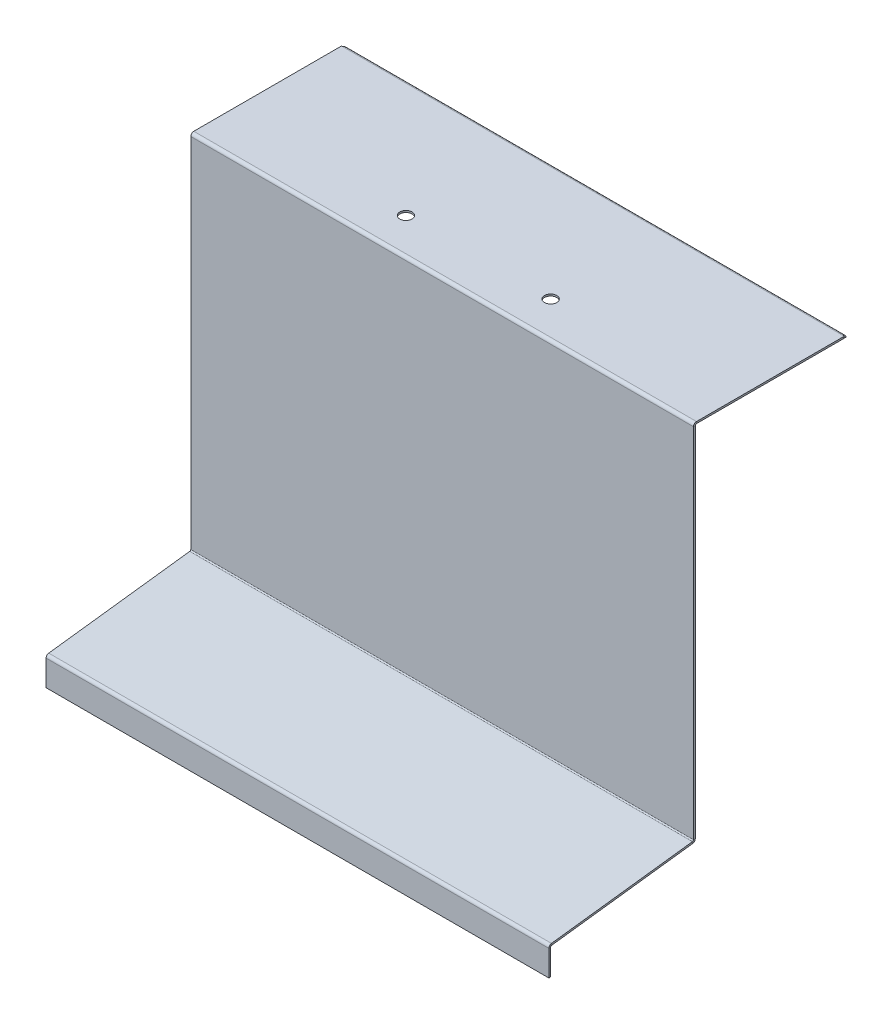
ISO-10303-21;
HEADER;
FILE_DESCRIPTION(('STEP AP214'),'2;1');
FILE_NAME('part.step','',(''),(''),'','','');
FILE_SCHEMA(('AUTOMOTIVE_DESIGN { 1 0 10303 214 1 1 1 1 }'));
ENDSEC;
DATA;
#1=APPLICATION_CONTEXT('core data for automotive mechanical design processes');
#2=APPLICATION_PROTOCOL_DEFINITION('international standard','automotive_design',2000,#1);
#3=PRODUCT_CONTEXT('',#1,'mechanical');
#4=PRODUCT('Part','Part','',(#3));
#5=PRODUCT_RELATED_PRODUCT_CATEGORY('part','',(#4));
#6=PRODUCT_DEFINITION_FORMATION('','',#4);
#7=PRODUCT_DEFINITION_CONTEXT('part definition',#1,'design');
#8=PRODUCT_DEFINITION('design','',#6,#7);
#9=PRODUCT_DEFINITION_SHAPE('','',#8);
#10=(LENGTH_UNIT() NAMED_UNIT(*) SI_UNIT(.MILLI.,.METRE.));
#11=(NAMED_UNIT(*) PLANE_ANGLE_UNIT() SI_UNIT($,.RADIAN.));
#12=(NAMED_UNIT(*) SI_UNIT($,.STERADIAN.) SOLID_ANGLE_UNIT());
#13=UNCERTAINTY_MEASURE_WITH_UNIT(LENGTH_MEASURE(1.E-05),#10,'distance_accuracy_value','');
#14=(GEOMETRIC_REPRESENTATION_CONTEXT(3) GLOBAL_UNCERTAINTY_ASSIGNED_CONTEXT((#13)) GLOBAL_UNIT_ASSIGNED_CONTEXT((#10,
#11,#12)) REPRESENTATION_CONTEXT('',''));
#15=CARTESIAN_POINT('',(0.,0.,0.));
#16=DIRECTION('',(0.,0.,1.));
#17=DIRECTION('',(1.,0.,0.));
#18=AXIS2_PLACEMENT_3D('',#15,#16,#17);
#19=CARTESIAN_POINT('',(0.,338.5,-125.));
#20=DIRECTION('',(0.,-1.,0.));
#21=DIRECTION('',(0.,0.,-1.));
#22=AXIS2_PLACEMENT_3D('',#19,#20,#21);
#23=PLANE('',#22);
#24=CARTESIAN_POINT('',(148.5,338.5,-30.));
#25=DIRECTION('',(0.,-1.,0.));
#26=DIRECTION('',(0.,0.,-1.));
#27=AXIS2_PLACEMENT_3D('',#24,#25,#26);
#28=CIRCLE('',#27,5.09999999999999);
#29=CARTESIAN_POINT('',(148.5,338.5,-35.1));
#30=VERTEX_POINT('',#29);
#31=EDGE_CURVE('E704',#30,#30,#28,.T.);
#32=ORIENTED_EDGE('',*,*,#31,.F.);
#33=EDGE_LOOP('',(#32));
#34=FACE_BOUND('',#33,.T.);
#35=CARTESIAN_POINT('',(268.5,338.5,-30.));
#36=DIRECTION('',(0.,-1.,0.));
#37=DIRECTION('',(0.,0.,-1.));
#38=AXIS2_PLACEMENT_3D('',#35,#36,#37);
#39=CIRCLE('',#38,5.09999999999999);
#40=CARTESIAN_POINT('',(268.5,338.5,-35.1));
#41=VERTEX_POINT('',#40);
#42=EDGE_CURVE('E698',#41,#41,#39,.T.);
#43=ORIENTED_EDGE('',*,*,#42,.F.);
#44=EDGE_LOOP('',(#43));
#45=FACE_BOUND('',#44,.T.);
#46=DIRECTION('',(1.,0.,0.));
#47=VECTOR('',#46,1.);
#48=CARTESIAN_POINT('',(0.,338.5,-125.));
#49=LINE('',#48,#47);
#50=CARTESIAN_POINT('',(1.07071068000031,338.5,-125.));
#51=VERTEX_POINT('',#50);
#52=CARTESIAN_POINT('',(0.,338.5,-125.));
#53=VERTEX_POINT('',#52);
#54=EDGE_CURVE('E76',#51,#53,#49,.F.);
#55=ORIENTED_EDGE('',*,*,#54,.F.);
#56=DIRECTION('',(1.,0.,0.));
#57=VECTOR('',#56,1.);
#58=CARTESIAN_POINT('',(0.,338.5,-125.000000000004));
#59=LINE('',#58,#57);
#60=CARTESIAN_POINT('',(415.9292893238,338.5,-125.));
#61=VERTEX_POINT('',#60);
#62=EDGE_CURVE('E60',#51,#61,#59,.T.);
#63=ORIENTED_EDGE('',*,*,#62,.T.);
#64=CARTESIAN_POINT('',(417.,338.5,-125.));
#65=VERTEX_POINT('',#64);
#66=EDGE_CURVE('E436',#65,#61,#49,.F.);
#67=ORIENTED_EDGE('',*,*,#66,.F.);
#68=DIRECTION('',(0.,0.,-1.));
#69=VECTOR('',#68,1.);
#70=CARTESIAN_POINT('',(417.,338.5,-125.));
#71=LINE('',#70,#69);
#72=CARTESIAN_POINT('',(417.,338.5,-2.5));
#73=VERTEX_POINT('',#72);
#74=EDGE_CURVE('E429',#73,#65,#71,.T.);
#75=ORIENTED_EDGE('',*,*,#74,.F.);
#76=DIRECTION('',(1.,0.,0.));
#77=VECTOR('',#76,1.);
#78=CARTESIAN_POINT('',(0.,338.5,-2.5));
#79=LINE('',#78,#77);
#80=CARTESIAN_POINT('',(0.,338.5,-2.5));
#81=VERTEX_POINT('',#80);
#82=EDGE_CURVE('E403',#81,#73,#79,.T.);
#83=ORIENTED_EDGE('',*,*,#82,.F.);
#84=DIRECTION('',(0.,0.,-1.));
#85=VECTOR('',#84,1.);
#86=CARTESIAN_POINT('',(0.,338.5,-125.));
#87=LINE('',#86,#85);
#88=EDGE_CURVE('E434',#53,#81,#87,.F.);
#89=ORIENTED_EDGE('',*,*,#88,.F.);
#90=EDGE_LOOP('',(#55,#63,#67,#75,#83,#89));
#91=FACE_BOUND('',#90,.T.);
#92=ADVANCED_FACE('F52',(#34,#45,#91),#23,.T.);
#93=CARTESIAN_POINT('',(0.,340.,-125.));
#94=DIRECTION('',(0.,-1.,0.));
#95=DIRECTION('',(0.,0.,-1.));
#96=AXIS2_PLACEMENT_3D('',#93,#94,#95);
#97=PLANE('',#96);
#98=CARTESIAN_POINT('',(148.5,340.,-30.));
#99=DIRECTION('',(0.,1.,0.));
#100=DIRECTION('',(0.,0.,1.));
#101=AXIS2_PLACEMENT_3D('',#98,#99,#100);
#102=CIRCLE('',#101,5.09999999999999);
#103=CARTESIAN_POINT('',(148.5,340.,-24.9));
#104=VERTEX_POINT('',#103);
#105=EDGE_CURVE('E707',#104,#104,#102,.T.);
#106=ORIENTED_EDGE('',*,*,#105,.F.);
#107=EDGE_LOOP('',(#106));
#108=FACE_BOUND('',#107,.T.);
#109=CARTESIAN_POINT('',(268.5,340.,-30.));
#110=DIRECTION('',(0.,1.,0.));
#111=DIRECTION('',(0.,0.,1.));
#112=AXIS2_PLACEMENT_3D('',#109,#110,#111);
#113=CIRCLE('',#112,5.09999999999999);
#114=CARTESIAN_POINT('',(268.5,340.,-24.9));
#115=VERTEX_POINT('',#114);
#116=EDGE_CURVE('E701',#115,#115,#113,.T.);
#117=ORIENTED_EDGE('',*,*,#116,.F.);
#118=EDGE_LOOP('',(#117));
#119=FACE_BOUND('',#118,.T.);
#120=DIRECTION('',(1.,0.,0.));
#121=VECTOR('',#120,1.);
#122=CARTESIAN_POINT('',(0.,340.,-125.000000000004));
#123=LINE('',#122,#121);
#124=CARTESIAN_POINT('',(1.07071068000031,340.,-125.));
#125=VERTEX_POINT('',#124);
#126=CARTESIAN_POINT('',(415.9292893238,340.,-125.));
#127=VERTEX_POINT('',#126);
#128=EDGE_CURVE('E484',#125,#127,#123,.T.);
#129=ORIENTED_EDGE('',*,*,#128,.F.);
#130=DIRECTION('',(-1.,0.,0.));
#131=VECTOR('',#130,1.);
#132=CARTESIAN_POINT('',(0.,340.,-125.));
#133=LINE('',#132,#131);
#134=CARTESIAN_POINT('',(0.,340.,-125.));
#135=VERTEX_POINT('',#134);
#136=EDGE_CURVE('E412',#125,#135,#133,.T.);
#137=ORIENTED_EDGE('',*,*,#136,.T.);
#138=DIRECTION('',(0.,0.,1.));
#139=VECTOR('',#138,1.);
#140=CARTESIAN_POINT('',(0.,340.,0.));
#141=LINE('',#140,#139);
#142=CARTESIAN_POINT('',(0.,340.,-2.49999999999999));
#143=VERTEX_POINT('',#142);
#144=EDGE_CURVE('E424',#135,#143,#141,.T.);
#145=ORIENTED_EDGE('',*,*,#144,.T.);
#146=DIRECTION('',(1.,0.,0.));
#147=VECTOR('',#146,1.);
#148=CARTESIAN_POINT('',(0.,340.,-2.5));
#149=LINE('',#148,#147);
#150=CARTESIAN_POINT('',(417.,340.,-2.5));
#151=VERTEX_POINT('',#150);
#152=EDGE_CURVE('E422',#143,#151,#149,.T.);
#153=ORIENTED_EDGE('',*,*,#152,.T.);
#154=DIRECTION('',(0.,0.,-1.));
#155=VECTOR('',#154,1.);
#156=CARTESIAN_POINT('',(417.,340.,0.));
#157=LINE('',#156,#155);
#158=CARTESIAN_POINT('',(417.,340.,-125.));
#159=VERTEX_POINT('',#158);
#160=EDGE_CURVE('E419',#151,#159,#157,.T.);
#161=ORIENTED_EDGE('',*,*,#160,.T.);
#162=EDGE_CURVE('E414',#159,#127,#133,.T.);
#163=ORIENTED_EDGE('',*,*,#162,.T.);
#164=EDGE_LOOP('',(#129,#137,#145,#153,#161,#163));
#165=FACE_BOUND('',#164,.T.);
#166=ADVANCED_FACE('F713',(#108,#119,#165),#97,.F.);
#167=CARTESIAN_POINT('',(417.,40.,0.));
#168=DIRECTION('',(-1.,0.,0.));
#169=DIRECTION('',(0.,-0.124034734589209,0.992277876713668));
#170=AXIS2_PLACEMENT_3D('',#167,#168,#169);
#171=PLANE('',#170);
#172=DIRECTION('',(0.,0.992277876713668,0.124034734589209));
#173=VECTOR('',#172,1.);
#174=CARTESIAN_POINT('',(417.,25.2737391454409,117.810086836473));
#175=LINE('',#174,#173);
#176=CARTESIAN_POINT('',(417.,23.7853223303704,117.624034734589));
#177=VERTEX_POINT('',#176);
#178=CARTESIAN_POINT('',(417.,25.2737391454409,117.810086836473));
#179=VERTEX_POINT('',#178);
#180=EDGE_CURVE('E481',#177,#179,#175,.T.);
#181=ORIENTED_EDGE('',*,*,#180,.F.);
#182=DIRECTION('',(0.,-0.124034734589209,0.992277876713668));
#183=VECTOR('',#182,1.);
#184=CARTESIAN_POINT('',(417.,38.5115831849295,-0.186052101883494));
#185=LINE('',#184,#183);
#186=CARTESIAN_POINT('',(417.,38.4020875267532,0.689913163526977));
#187=VERTEX_POINT('',#186);
#188=EDGE_CURVE('E457',#187,#177,#185,.T.);
#189=ORIENTED_EDGE('',*,*,#188,.F.);
#190=DIRECTION('',(-1.11022302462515E-13,0.992277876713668,0.124034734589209));
#191=VECTOR('',#190,1.);
#192=CARTESIAN_POINT('',(417.,39.8905043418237,0.875965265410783));
#193=LINE('',#192,#191);
#194=CARTESIAN_POINT('',(417.,39.8905043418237,0.87596526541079));
#195=VERTEX_POINT('',#194);
#196=EDGE_CURVE('E463',#187,#195,#193,.T.);
#197=ORIENTED_EDGE('',*,*,#196,.T.);
#198=DIRECTION('',(0.,-0.124034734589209,0.992277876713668));
#199=VECTOR('',#198,1.);
#200=CARTESIAN_POINT('',(417.,40.,0.));
#201=LINE('',#200,#199);
#202=EDGE_CURVE('E456',#195,#179,#201,.T.);
#203=ORIENTED_EDGE('',*,*,#202,.T.);
#204=EDGE_LOOP('',(#181,#189,#197,#203));
#205=FACE_BOUND('',#204,.T.);
#206=ADVANCED_FACE('F716',(#205),#171,.F.);
#207=CARTESIAN_POINT('',(0.,40.,3.33066907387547E-13));
#208=DIRECTION('',(1.,0.,0.));
#209=DIRECTION('',(0.,0.124034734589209,-0.992277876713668));
#210=AXIS2_PLACEMENT_3D('',#207,#208,#209);
#211=PLANE('',#210);
#212=DIRECTION('',(0.,0.992277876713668,0.124034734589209));
#213=VECTOR('',#212,1.);
#214=CARTESIAN_POINT('',(0.,39.8905043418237,0.87596526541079));
#215=LINE('',#214,#213);
#216=CARTESIAN_POINT('',(0.,38.4020875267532,0.689913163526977));
#217=VERTEX_POINT('',#216);
#218=CARTESIAN_POINT('',(0.,39.8905043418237,0.875965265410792));
#219=VERTEX_POINT('',#218);
#220=EDGE_CURVE('E469',#217,#219,#215,.T.);
#221=ORIENTED_EDGE('',*,*,#220,.F.);
#222=DIRECTION('',(0.,-0.124034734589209,0.992277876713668));
#223=VECTOR('',#222,1.);
#224=CARTESIAN_POINT('',(0.,38.5115831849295,-0.18605210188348));
#225=LINE('',#224,#223);
#226=CARTESIAN_POINT('',(0.,23.7853223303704,117.624034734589));
#227=VERTEX_POINT('',#226);
#228=EDGE_CURVE('E366',#227,#217,#225,.F.);
#229=ORIENTED_EDGE('',*,*,#228,.F.);
#230=DIRECTION('',(0.,0.992277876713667,0.12403473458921));
#231=VECTOR('',#230,1.);
#232=CARTESIAN_POINT('',(0.,25.2737391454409,117.810086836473));
#233=LINE('',#232,#231);
#234=CARTESIAN_POINT('',(0.,25.2737391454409,117.810086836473));
#235=VERTEX_POINT('',#234);
#236=EDGE_CURVE('E475',#227,#235,#233,.T.);
#237=ORIENTED_EDGE('',*,*,#236,.T.);
#238=DIRECTION('',(0.,0.124034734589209,-0.992277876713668));
#239=VECTOR('',#238,1.);
#240=CARTESIAN_POINT('',(0.,40.,3.33066907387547E-13));
#241=LINE('',#240,#239);
#242=EDGE_CURVE('E453',#235,#219,#241,.T.);
#243=ORIENTED_EDGE('',*,*,#242,.T.);
#244=EDGE_LOOP('',(#221,#229,#237,#243));
#245=FACE_BOUND('',#244,.T.);
#246=ADVANCED_FACE('F980',(#245),#211,.F.);
#247=CARTESIAN_POINT('',(-126.491106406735,40.,3.33066907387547E-13));
#248=DIRECTION('',(0.,0.992277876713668,0.124034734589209));
#249=DIRECTION('',(0.,-0.124034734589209,0.992277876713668));
#250=AXIS2_PLACEMENT_3D('',#247,#248,#249);
#251=PLANE('',#250);
#252=ORIENTED_EDGE('',*,*,#202,.F.);
#253=DIRECTION('',(-1.,0.,0.));
#254=VECTOR('',#253,1.);
#255=CARTESIAN_POINT('',(-126.491106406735,39.8905043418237,0.875965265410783));
#256=LINE('',#255,#254);
#257=EDGE_CURVE('E459',#195,#219,#256,.T.);
#258=ORIENTED_EDGE('',*,*,#257,.T.);
#259=ORIENTED_EDGE('',*,*,#242,.F.);
#260=DIRECTION('',(1.,0.,0.));
#261=VECTOR('',#260,1.);
#262=CARTESIAN_POINT('',(-126.491106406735,25.2737391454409,117.810086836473));
#263=LINE('',#262,#261);
#264=EDGE_CURVE('E472',#235,#179,#263,.T.);
#265=ORIENTED_EDGE('',*,*,#264,.T.);
#266=EDGE_LOOP('',(#252,#258,#259,#265));
#267=FACE_BOUND('',#266,.T.);
#268=ADVANCED_FACE('F974',(#267),#251,.T.);
#269=CARTESIAN_POINT('',(-126.491106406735,38.5115831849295,-0.18605210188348));
#270=DIRECTION('',(0.,0.992277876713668,0.124034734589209));
#271=DIRECTION('',(0.,-0.124034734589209,0.992277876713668));
#272=AXIS2_PLACEMENT_3D('',#269,#270,#271);
#273=PLANE('',#272);
#274=ORIENTED_EDGE('',*,*,#188,.T.);
#275=DIRECTION('',(1.,0.,0.));
#276=VECTOR('',#275,1.);
#277=CARTESIAN_POINT('',(-126.491106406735,23.7853223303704,117.624034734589));
#278=LINE('',#277,#276);
#279=EDGE_CURVE('E478',#227,#177,#278,.T.);
#280=ORIENTED_EDGE('',*,*,#279,.F.);
#281=ORIENTED_EDGE('',*,*,#228,.T.);
#282=DIRECTION('',(-1.,0.,0.));
#283=VECTOR('',#282,1.);
#284=CARTESIAN_POINT('',(-126.491106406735,38.4020875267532,0.689913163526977));
#285=LINE('',#284,#283);
#286=EDGE_CURVE('E466',#187,#217,#285,.T.);
#287=ORIENTED_EDGE('',*,*,#286,.F.);
#288=EDGE_LOOP('',(#274,#280,#281,#287));
#289=FACE_BOUND('',#288,.T.);
#290=ADVANCED_FACE('F970',(#289),#273,.F.);
#291=CARTESIAN_POINT('',(0.,340.,-125.));
#292=DIRECTION('',(0.,0.,1.));
#293=DIRECTION('',(-1.,0.,0.));
#294=AXIS2_PLACEMENT_3D('',#291,#292,#293);
#295=PLANE('',#294);
#296=DIRECTION('',(0.,1.,0.));
#297=VECTOR('',#296,1.);
#298=CARTESIAN_POINT('',(1.07071068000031,338.5,-125.));
#299=LINE('',#298,#297);
#300=EDGE_CURVE('E12',#51,#125,#299,.T.);
#301=ORIENTED_EDGE('',*,*,#300,.F.);
#302=ORIENTED_EDGE('',*,*,#54,.T.);
#303=DIRECTION('',(0.,1.,0.));
#304=VECTOR('',#303,1.);
#305=CARTESIAN_POINT('',(0.,340.,-125.));
#306=LINE('',#305,#304);
#307=EDGE_CURVE('E438',#53,#135,#306,.T.);
#308=ORIENTED_EDGE('',*,*,#307,.T.);
#309=ORIENTED_EDGE('',*,*,#136,.F.);
#310=EDGE_LOOP('',(#301,#302,#308,#309));
#311=FACE_BOUND('',#310,.T.);
#312=ADVANCED_FACE('F729',(#311),#295,.F.);
#313=ORIENTED_EDGE('',*,*,#66,.T.);
#314=DIRECTION('',(0.,1.,0.));
#315=VECTOR('',#314,1.);
#316=CARTESIAN_POINT('',(415.9292893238,338.5,-125.));
#317=LINE('',#316,#315);
#318=EDGE_CURVE('E487',#61,#127,#317,.T.);
#319=ORIENTED_EDGE('',*,*,#318,.T.);
#320=ORIENTED_EDGE('',*,*,#162,.F.);
#321=DIRECTION('',(0.,1.,0.));
#322=VECTOR('',#321,1.);
#323=CARTESIAN_POINT('',(417.,340.,-125.));
#324=LINE('',#323,#322);
#325=EDGE_CURVE('E427',#65,#159,#324,.T.);
#326=ORIENTED_EDGE('',*,*,#325,.F.);
#327=EDGE_LOOP('',(#313,#319,#320,#326));
#328=FACE_BOUND('',#327,.T.);
#329=ADVANCED_FACE('F736',(#328),#295,.F.);
#330=CARTESIAN_POINT('',(0.,340.,0.));
#331=DIRECTION('',(1.,0.,0.));
#332=DIRECTION('',(0.,0.,1.));
#333=AXIS2_PLACEMENT_3D('',#330,#331,#332);
#334=PLANE('',#333);
#335=ORIENTED_EDGE('',*,*,#307,.F.);
#336=ORIENTED_EDGE('',*,*,#88,.T.);
#337=DIRECTION('',(0.,1.,0.));
#338=VECTOR('',#337,1.);
#339=CARTESIAN_POINT('',(0.,340.,-2.5));
#340=LINE('',#339,#338);
#341=EDGE_CURVE('E432',#81,#143,#340,.T.);
#342=ORIENTED_EDGE('',*,*,#341,.T.);
#343=ORIENTED_EDGE('',*,*,#144,.F.);
#344=EDGE_LOOP('',(#335,#336,#342,#343));
#345=FACE_BOUND('',#344,.T.);
#346=ADVANCED_FACE('F772',(#345),#334,.F.);
#347=CARTESIAN_POINT('',(417.,340.,0.));
#348=DIRECTION('',(-1.,0.,0.));
#349=DIRECTION('',(0.,0.,-1.));
#350=AXIS2_PLACEMENT_3D('',#347,#348,#349);
#351=PLANE('',#350);
#352=DIRECTION('',(0.,1.,0.));
#353=VECTOR('',#352,1.);
#354=CARTESIAN_POINT('',(417.,340.,-2.5));
#355=LINE('',#354,#353);
#356=EDGE_CURVE('E394',#73,#151,#355,.T.);
#357=ORIENTED_EDGE('',*,*,#356,.F.);
#358=ORIENTED_EDGE('',*,*,#74,.T.);
#359=ORIENTED_EDGE('',*,*,#325,.T.);
#360=ORIENTED_EDGE('',*,*,#160,.F.);
#361=EDGE_LOOP('',(#357,#358,#359,#360));
#362=FACE_BOUND('',#361,.T.);
#363=ADVANCED_FACE('F740',(#362),#351,.F.);
#364=CARTESIAN_POINT('',(0.,337.5,-2.5));
#365=DIRECTION('',(-1.,0.,0.));
#366=DIRECTION('',(0.,0.,1.));
#367=AXIS2_PLACEMENT_3D('',#364,#365,#366);
#368=PLANE('',#367);
#369=ORIENTED_EDGE('',*,*,#341,.F.);
#370=CARTESIAN_POINT('',(0.,337.5,-2.5));
#371=DIRECTION('',(-1.,0.,0.));
#372=DIRECTION('',(0.,0.,1.));
#373=AXIS2_PLACEMENT_3D('',#370,#371,#372);
#374=CIRCLE('',#373,1.);
#375=CARTESIAN_POINT('',(0.,337.5,-1.5));
#376=VERTEX_POINT('',#375);
#377=EDGE_CURVE('E409',#81,#376,#374,.F.);
#378=ORIENTED_EDGE('',*,*,#377,.T.);
#379=DIRECTION('',(0.,0.,1.));
#380=VECTOR('',#379,1.);
#381=CARTESIAN_POINT('',(0.,337.5,0.));
#382=LINE('',#381,#380);
#383=CARTESIAN_POINT('',(0.,337.5,0.));
#384=VERTEX_POINT('',#383);
#385=EDGE_CURVE('E406',#376,#384,#382,.T.);
#386=ORIENTED_EDGE('',*,*,#385,.T.);
#387=CARTESIAN_POINT('',(0.,337.5,-2.5));
#388=DIRECTION('',(1.,0.,0.));
#389=DIRECTION('',(0.,0.,-1.));
#390=AXIS2_PLACEMENT_3D('',#387,#388,#389);
#391=CIRCLE('',#390,2.5);
#392=EDGE_CURVE('E391',#143,#384,#391,.T.);
#393=ORIENTED_EDGE('',*,*,#392,.F.);
#394=EDGE_LOOP('',(#369,#378,#386,#393));
#395=FACE_BOUND('',#394,.T.);
#396=ADVANCED_FACE('F750',(#395),#368,.T.);
#397=CARTESIAN_POINT('',(625.511758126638,337.5,-2.5));
#398=DIRECTION('',(-1.,0.,0.));
#399=DIRECTION('',(0.,0.,1.));
#400=AXIS2_PLACEMENT_3D('',#397,#398,#399);
#401=CYLINDRICAL_SURFACE('',#400,1.);
#402=ORIENTED_EDGE('',*,*,#377,.F.);
#403=ORIENTED_EDGE('',*,*,#82,.T.);
#404=CARTESIAN_POINT('',(417.,337.5,-2.5));
#405=DIRECTION('',(-1.,0.,0.));
#406=DIRECTION('',(0.,0.,1.));
#407=AXIS2_PLACEMENT_3D('',#404,#405,#406);
#408=CIRCLE('',#407,1.);
#409=CARTESIAN_POINT('',(417.,337.5,-1.5));
#410=VERTEX_POINT('',#409);
#411=EDGE_CURVE('E397',#410,#73,#408,.T.);
#412=ORIENTED_EDGE('',*,*,#411,.F.);
#413=DIRECTION('',(-1.,0.,0.));
#414=VECTOR('',#413,1.);
#415=CARTESIAN_POINT('',(0.,337.5,-1.5));
#416=LINE('',#415,#414);
#417=EDGE_CURVE('E400',#410,#376,#416,.T.);
#418=ORIENTED_EDGE('',*,*,#417,.T.);
#419=EDGE_LOOP('',(#402,#403,#412,#418));
#420=FACE_BOUND('',#419,.T.);
#421=ADVANCED_FACE('F770',(#420),#401,.F.);
#422=CARTESIAN_POINT('',(417.,337.5,-2.5));
#423=DIRECTION('',(1.,0.,0.));
#424=DIRECTION('',(0.,0.,-1.));
#425=AXIS2_PLACEMENT_3D('',#422,#423,#424);
#426=PLANE('',#425);
#427=DIRECTION('',(0.,0.,1.));
#428=VECTOR('',#427,1.);
#429=CARTESIAN_POINT('',(417.,337.5,0.));
#430=LINE('',#429,#428);
#431=CARTESIAN_POINT('',(417.,337.5,0.));
#432=VERTEX_POINT('',#431);
#433=EDGE_CURVE('E373',#410,#432,#430,.T.);
#434=ORIENTED_EDGE('',*,*,#433,.F.);
#435=ORIENTED_EDGE('',*,*,#411,.T.);
#436=ORIENTED_EDGE('',*,*,#356,.T.);
#437=CARTESIAN_POINT('',(417.,337.5,-2.5));
#438=DIRECTION('',(-1.,0.,0.));
#439=DIRECTION('',(0.,0.,1.));
#440=AXIS2_PLACEMENT_3D('',#437,#438,#439);
#441=CIRCLE('',#440,2.5);
#442=EDGE_CURVE('E388',#432,#151,#441,.T.);
#443=ORIENTED_EDGE('',*,*,#442,.F.);
#444=EDGE_LOOP('',(#434,#435,#436,#443));
#445=FACE_BOUND('',#444,.T.);
#446=ADVANCED_FACE('F767',(#445),#426,.T.);
#447=CARTESIAN_POINT('',(625.511758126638,337.5,-2.5));
#448=DIRECTION('',(-1.,0.,0.));
#449=DIRECTION('',(0.,0.,1.));
#450=AXIS2_PLACEMENT_3D('',#447,#448,#449);
#451=CYLINDRICAL_SURFACE('',#450,2.5);
#452=ORIENTED_EDGE('',*,*,#392,.T.);
#453=DIRECTION('',(-1.,0.,0.));
#454=VECTOR('',#453,1.);
#455=CARTESIAN_POINT('',(0.,337.5,0.));
#456=LINE('',#455,#454);
#457=EDGE_CURVE('E383',#432,#384,#456,.T.);
#458=ORIENTED_EDGE('',*,*,#457,.F.);
#459=ORIENTED_EDGE('',*,*,#442,.T.);
#460=ORIENTED_EDGE('',*,*,#152,.F.);
#461=EDGE_LOOP('',(#452,#458,#459,#460));
#462=FACE_BOUND('',#461,.T.);
#463=ADVANCED_FACE('F745',(#462),#451,.T.);
#464=CARTESIAN_POINT('',(0.,340.,0.));
#465=DIRECTION('',(0.,0.,-1.));
#466=DIRECTION('',(-1.,0.,0.));
#467=AXIS2_PLACEMENT_3D('',#464,#465,#466);
#468=PLANE('',#467);
#469=DIRECTION('',(0.,-1.,0.));
#470=VECTOR('',#469,1.);
#471=CARTESIAN_POINT('',(417.,340.,0.));
#472=LINE('',#471,#470);
#473=CARTESIAN_POINT('',(417.,40.8827822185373,0.));
#474=VERTEX_POINT('',#473);
#475=EDGE_CURVE('E371',#432,#474,#472,.T.);
#476=ORIENTED_EDGE('',*,*,#475,.F.);
#477=ORIENTED_EDGE('',*,*,#457,.T.);
#478=DIRECTION('',(0.,-1.,0.));
#479=VECTOR('',#478,1.);
#480=CARTESIAN_POINT('',(0.,340.,0.));
#481=LINE('',#480,#479);
#482=CARTESIAN_POINT('',(0.,40.8827822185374,0.));
#483=VERTEX_POINT('',#482);
#484=EDGE_CURVE('E381',#384,#483,#481,.T.);
#485=ORIENTED_EDGE('',*,*,#484,.T.);
#486=DIRECTION('',(1.,0.,0.));
#487=VECTOR('',#486,1.);
#488=CARTESIAN_POINT('',(0.,40.8827822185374,0.));
#489=LINE('',#488,#487);
#490=EDGE_CURVE('E378',#483,#474,#489,.T.);
#491=ORIENTED_EDGE('',*,*,#490,.T.);
#492=EDGE_LOOP('',(#476,#477,#485,#491));
#493=FACE_BOUND('',#492,.T.);
#494=ADVANCED_FACE('F759',(#493),#468,.F.);
#495=CARTESIAN_POINT('',(417.,340.,0.));
#496=DIRECTION('',(1.,0.,0.));
#497=DIRECTION('',(0.,-1.,0.));
#498=AXIS2_PLACEMENT_3D('',#495,#496,#497);
#499=PLANE('',#498);
#500=DIRECTION('',(0.,0.,1.));
#501=VECTOR('',#500,1.);
#502=CARTESIAN_POINT('',(417.,40.8827822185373,0.));
#503=LINE('',#502,#501);
#504=CARTESIAN_POINT('',(417.,40.8827822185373,-1.5));
#505=VERTEX_POINT('',#504);
#506=EDGE_CURVE('E444',#505,#474,#503,.T.);
#507=ORIENTED_EDGE('',*,*,#506,.F.);
#508=DIRECTION('',(0.,1.,0.));
#509=VECTOR('',#508,1.);
#510=CARTESIAN_POINT('',(417.,340.,-1.5));
#511=LINE('',#510,#509);
#512=EDGE_CURVE('E369',#410,#505,#511,.F.);
#513=ORIENTED_EDGE('',*,*,#512,.F.);
#514=ORIENTED_EDGE('',*,*,#433,.T.);
#515=ORIENTED_EDGE('',*,*,#475,.T.);
#516=EDGE_LOOP('',(#507,#513,#514,#515));
#517=FACE_BOUND('',#516,.T.);
#518=ADVANCED_FACE('F763',(#517),#499,.T.);
#519=CARTESIAN_POINT('',(0.,340.,-1.5));
#520=DIRECTION('',(0.,0.,-1.));
#521=DIRECTION('',(-1.,0.,0.));
#522=AXIS2_PLACEMENT_3D('',#519,#520,#521);
#523=PLANE('',#522);
#524=ORIENTED_EDGE('',*,*,#512,.T.);
#525=DIRECTION('',(1.,0.,0.));
#526=VECTOR('',#525,1.);
#527=CARTESIAN_POINT('',(0.,40.8827822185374,-1.5));
#528=LINE('',#527,#526);
#529=CARTESIAN_POINT('',(0.,40.8827822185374,-1.5));
#530=VERTEX_POINT('',#529);
#531=EDGE_CURVE('E358',#530,#505,#528,.T.);
#532=ORIENTED_EDGE('',*,*,#531,.F.);
#533=DIRECTION('',(0.,1.,0.));
#534=VECTOR('',#533,1.);
#535=CARTESIAN_POINT('',(0.,340.,-1.5));
#536=LINE('',#535,#534);
#537=EDGE_CURVE('E367',#376,#530,#536,.F.);
#538=ORIENTED_EDGE('',*,*,#537,.F.);
#539=ORIENTED_EDGE('',*,*,#417,.F.);
#540=EDGE_LOOP('',(#524,#532,#538,#539));
#541=FACE_BOUND('',#540,.T.);
#542=ADVANCED_FACE('F1012',(#541),#523,.T.);
#543=CARTESIAN_POINT('',(0.,340.,0.));
#544=DIRECTION('',(1.,0.,0.));
#545=DIRECTION('',(0.,-1.,0.));
#546=AXIS2_PLACEMENT_3D('',#543,#544,#545);
#547=PLANE('',#546);
#548=ORIENTED_EDGE('',*,*,#385,.F.);
#549=ORIENTED_EDGE('',*,*,#537,.T.);
#550=DIRECTION('',(0.,0.,1.));
#551=VECTOR('',#550,1.);
#552=CARTESIAN_POINT('',(0.,40.8827822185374,0.));
#553=LINE('',#552,#551);
#554=EDGE_CURVE('E363',#530,#483,#553,.T.);
#555=ORIENTED_EDGE('',*,*,#554,.T.);
#556=ORIENTED_EDGE('',*,*,#484,.F.);
#557=EDGE_LOOP('',(#548,#549,#555,#556));
#558=FACE_BOUND('',#557,.T.);
#559=ADVANCED_FACE('F754',(#558),#547,.F.);
#560=CARTESIAN_POINT('',(417.,40.8827822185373,1.));
#561=DIRECTION('',(-1.,0.,0.));
#562=DIRECTION('',(0.,0.,1.));
#563=AXIS2_PLACEMENT_3D('',#560,#561,#562);
#564=PLANE('',#563);
#565=ORIENTED_EDGE('',*,*,#196,.F.);
#566=CARTESIAN_POINT('',(417.,40.8827822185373,1.));
#567=DIRECTION('',(1.,0.,0.));
#568=DIRECTION('',(0.,1.,0.));
#569=AXIS2_PLACEMENT_3D('',#566,#567,#568);
#570=CIRCLE('',#569,2.5);
#571=EDGE_CURVE('E348',#187,#505,#570,.T.);
#572=ORIENTED_EDGE('',*,*,#571,.T.);
#573=ORIENTED_EDGE('',*,*,#506,.T.);
#574=CARTESIAN_POINT('',(417.,40.8827822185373,1.));
#575=DIRECTION('',(1.,0.,0.));
#576=DIRECTION('',(0.,0.,-1.));
#577=AXIS2_PLACEMENT_3D('',#574,#575,#576);
#578=CIRCLE('',#577,1.);
#579=EDGE_CURVE('E351',#195,#474,#578,.T.);
#580=ORIENTED_EDGE('',*,*,#579,.F.);
#581=EDGE_LOOP('',(#565,#572,#573,#580));
#582=FACE_BOUND('',#581,.T.);
#583=ADVANCED_FACE('F965',(#582),#564,.F.);
#584=CARTESIAN_POINT('',(0.,40.8827822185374,1.));
#585=DIRECTION('',(1.,0.,0.));
#586=DIRECTION('',(0.,1.,0.));
#587=AXIS2_PLACEMENT_3D('',#584,#585,#586);
#588=PLANE('',#587);
#589=ORIENTED_EDGE('',*,*,#554,.F.);
#590=CARTESIAN_POINT('',(0.,40.8827822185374,1.));
#591=DIRECTION('',(1.,0.,0.));
#592=DIRECTION('',(0.,1.,0.));
#593=AXIS2_PLACEMENT_3D('',#590,#591,#592);
#594=CIRCLE('',#593,2.5);
#595=EDGE_CURVE('E355',#530,#217,#594,.F.);
#596=ORIENTED_EDGE('',*,*,#595,.T.);
#597=ORIENTED_EDGE('',*,*,#220,.T.);
#598=CARTESIAN_POINT('',(0.,40.8827822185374,1.));
#599=DIRECTION('',(-1.,0.,0.));
#600=DIRECTION('',(0.,-1.,0.));
#601=AXIS2_PLACEMENT_3D('',#598,#599,#600);
#602=CIRCLE('',#601,0.999999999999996);
#603=EDGE_CURVE('E354',#483,#219,#602,.T.);
#604=ORIENTED_EDGE('',*,*,#603,.F.);
#605=EDGE_LOOP('',(#589,#596,#597,#604));
#606=FACE_BOUND('',#605,.T.);
#607=ADVANCED_FACE('F958',(#606),#588,.F.);
#608=CARTESIAN_POINT('',(-208.510380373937,40.8827822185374,1.));
#609=DIRECTION('',(1.,0.,0.));
#610=DIRECTION('',(0.,1.,0.));
#611=AXIS2_PLACEMENT_3D('',#608,#609,#610);
#612=CYLINDRICAL_SURFACE('',#611,1.);
#613=ORIENTED_EDGE('',*,*,#603,.T.);
#614=ORIENTED_EDGE('',*,*,#257,.F.);
#615=ORIENTED_EDGE('',*,*,#579,.T.);
#616=ORIENTED_EDGE('',*,*,#490,.F.);
#617=EDGE_LOOP('',(#613,#614,#615,#616));
#618=FACE_BOUND('',#617,.T.);
#619=ADVANCED_FACE('F955',(#618),#612,.F.);
#620=CARTESIAN_POINT('',(-208.510380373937,40.8827822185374,1.));
#621=DIRECTION('',(1.,0.,0.));
#622=DIRECTION('',(0.,1.,0.));
#623=AXIS2_PLACEMENT_3D('',#620,#621,#622);
#624=CYLINDRICAL_SURFACE('',#623,2.5);
#625=ORIENTED_EDGE('',*,*,#595,.F.);
#626=ORIENTED_EDGE('',*,*,#531,.T.);
#627=ORIENTED_EDGE('',*,*,#571,.F.);
#628=ORIENTED_EDGE('',*,*,#286,.T.);
#629=EDGE_LOOP('',(#625,#626,#627,#628));
#630=FACE_BOUND('',#629,.T.);
#631=ADVANCED_FACE('F953',(#630),#624,.T.);
#632=CARTESIAN_POINT('',(417.,22.7930444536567,117.5));
#633=DIRECTION('',(1.,0.,0.));
#634=DIRECTION('',(0.,0.,-1.));
#635=AXIS2_PLACEMENT_3D('',#632,#633,#634);
#636=PLANE('',#635);
#637=DIRECTION('',(0.,0.,1.));
#638=VECTOR('',#637,1.);
#639=CARTESIAN_POINT('',(417.,22.7930444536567,120.));
#640=LINE('',#639,#638);
#641=CARTESIAN_POINT('',(417.,22.7930444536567,118.5));
#642=VERTEX_POINT('',#641);
#643=CARTESIAN_POINT('',(417.,22.7930444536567,120.));
#644=VERTEX_POINT('',#643);
#645=EDGE_CURVE('E316',#642,#644,#640,.T.);
#646=ORIENTED_EDGE('',*,*,#645,.F.);
#647=CARTESIAN_POINT('',(417.,22.7930444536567,117.5));
#648=DIRECTION('',(1.,0.,0.));
#649=DIRECTION('',(0.,0.,-1.));
#650=AXIS2_PLACEMENT_3D('',#647,#648,#649);
#651=CIRCLE('',#650,1.);
#652=EDGE_CURVE('E318',#642,#177,#651,.F.);
#653=ORIENTED_EDGE('',*,*,#652,.T.);
#654=ORIENTED_EDGE('',*,*,#180,.T.);
#655=CARTESIAN_POINT('',(417.,22.7930444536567,117.5));
#656=DIRECTION('',(-1.,0.,0.));
#657=DIRECTION('',(0.,0.,1.));
#658=AXIS2_PLACEMENT_3D('',#655,#656,#657);
#659=CIRCLE('',#658,2.5);
#660=EDGE_CURVE('E342',#644,#179,#659,.T.);
#661=ORIENTED_EDGE('',*,*,#660,.F.);
#662=EDGE_LOOP('',(#646,#653,#654,#661));
#663=FACE_BOUND('',#662,.T.);
#664=ADVANCED_FACE('F949',(#663),#636,.T.);
#665=CARTESIAN_POINT('',(0.,22.7930444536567,117.5));
#666=DIRECTION('',(-1.,0.,0.));
#667=DIRECTION('',(0.,0.,1.));
#668=AXIS2_PLACEMENT_3D('',#665,#666,#667);
#669=PLANE('',#668);
#670=ORIENTED_EDGE('',*,*,#236,.F.);
#671=CARTESIAN_POINT('',(-1.11022302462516E-13,22.7930444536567,117.5));
#672=DIRECTION('',(1.,0.,0.));
#673=DIRECTION('',(0.,0.,-1.));
#674=AXIS2_PLACEMENT_3D('',#671,#672,#673);
#675=CIRCLE('',#674,1.);
#676=CARTESIAN_POINT('',(0.,22.7930444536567,118.5));
#677=VERTEX_POINT('',#676);
#678=EDGE_CURVE('E321',#227,#677,#675,.T.);
#679=ORIENTED_EDGE('',*,*,#678,.T.);
#680=DIRECTION('',(0.,0.,1.));
#681=VECTOR('',#680,1.);
#682=CARTESIAN_POINT('',(0.,22.7930444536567,120.));
#683=LINE('',#682,#681);
#684=CARTESIAN_POINT('',(0.,22.7930444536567,120.));
#685=VERTEX_POINT('',#684);
#686=EDGE_CURVE('E335',#677,#685,#683,.T.);
#687=ORIENTED_EDGE('',*,*,#686,.T.);
#688=CARTESIAN_POINT('',(0.,22.7930444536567,117.5));
#689=DIRECTION('',(1.,0.,0.));
#690=DIRECTION('',(0.,0.,-1.));
#691=AXIS2_PLACEMENT_3D('',#688,#689,#690);
#692=CIRCLE('',#691,2.50000000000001);
#693=EDGE_CURVE('E345',#235,#685,#692,.T.);
#694=ORIENTED_EDGE('',*,*,#693,.F.);
#695=EDGE_LOOP('',(#670,#679,#687,#694));
#696=FACE_BOUND('',#695,.T.);
#697=ADVANCED_FACE('F942',(#696),#669,.T.);
#698=CARTESIAN_POINT('',(-208.512621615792,22.7930444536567,117.5));
#699=DIRECTION('',(1.,0.,0.));
#700=DIRECTION('',(0.,0.,-1.));
#701=AXIS2_PLACEMENT_3D('',#698,#699,#700);
#702=CYLINDRICAL_SURFACE('',#701,2.5);
#703=ORIENTED_EDGE('',*,*,#693,.T.);
#704=DIRECTION('',(-1.,0.,0.));
#705=VECTOR('',#704,1.);
#706=CARTESIAN_POINT('',(-126.491106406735,22.7930444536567,120.));
#707=LINE('',#706,#705);
#708=EDGE_CURVE('E333',#644,#685,#707,.T.);
#709=ORIENTED_EDGE('',*,*,#708,.F.);
#710=ORIENTED_EDGE('',*,*,#660,.T.);
#711=ORIENTED_EDGE('',*,*,#264,.F.);
#712=EDGE_LOOP('',(#703,#709,#710,#711));
#713=FACE_BOUND('',#712,.T.);
#714=ADVANCED_FACE('F939',(#713),#702,.T.);
#715=CARTESIAN_POINT('',(-208.512621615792,22.7930444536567,117.5));
#716=DIRECTION('',(1.,0.,0.));
#717=DIRECTION('',(0.,0.,-1.));
#718=AXIS2_PLACEMENT_3D('',#715,#716,#717);
#719=CYLINDRICAL_SURFACE('',#718,1.);
#720=ORIENTED_EDGE('',*,*,#678,.F.);
#721=ORIENTED_EDGE('',*,*,#279,.T.);
#722=ORIENTED_EDGE('',*,*,#652,.F.);
#723=DIRECTION('',(-1.,0.,0.));
#724=VECTOR('',#723,1.);
#725=CARTESIAN_POINT('',(-126.491106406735,22.7930444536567,118.5));
#726=LINE('',#725,#724);
#727=EDGE_CURVE('E338',#642,#677,#726,.T.);
#728=ORIENTED_EDGE('',*,*,#727,.T.);
#729=EDGE_LOOP('',(#720,#721,#722,#728));
#730=FACE_BOUND('',#729,.T.);
#731=ADVANCED_FACE('F929',(#730),#719,.F.);
#732=CARTESIAN_POINT('',(-126.491106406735,0.,120.));
#733=DIRECTION('',(0.,0.,1.));
#734=DIRECTION('',(1.,0.,0.));
#735=AXIS2_PLACEMENT_3D('',#732,#733,#734);
#736=PLANE('',#735);
#737=DIRECTION('',(-1.,0.,0.));
#738=VECTOR('',#737,1.);
#739=CARTESIAN_POINT('',(0.,1.5,120.));
#740=LINE('',#739,#738);
#741=CARTESIAN_POINT('',(417.,1.5,120.));
#742=VERTEX_POINT('',#741);
#743=CARTESIAN_POINT('',(0.,1.5,120.));
#744=VERTEX_POINT('',#743);
#745=EDGE_CURVE('E299',#742,#744,#740,.T.);
#746=ORIENTED_EDGE('',*,*,#745,.F.);
#747=DIRECTION('',(0.,-1.,0.));
#748=VECTOR('',#747,1.);
#749=CARTESIAN_POINT('',(417.,0.,120.));
#750=LINE('',#749,#748);
#751=EDGE_CURVE('E310',#644,#742,#750,.T.);
#752=ORIENTED_EDGE('',*,*,#751,.F.);
#753=ORIENTED_EDGE('',*,*,#708,.T.);
#754=DIRECTION('',(0.,1.,0.));
#755=VECTOR('',#754,1.);
#756=CARTESIAN_POINT('',(0.,0.,120.));
#757=LINE('',#756,#755);
#758=EDGE_CURVE('E312',#744,#685,#757,.T.);
#759=ORIENTED_EDGE('',*,*,#758,.F.);
#760=EDGE_LOOP('',(#746,#752,#753,#759));
#761=FACE_BOUND('',#760,.T.);
#762=ADVANCED_FACE('F308',(#761),#736,.T.);
#763=CARTESIAN_POINT('',(0.,0.,120.));
#764=DIRECTION('',(1.,0.,0.));
#765=DIRECTION('',(0.,1.,0.));
#766=AXIS2_PLACEMENT_3D('',#763,#764,#765);
#767=PLANE('',#766);
#768=DIRECTION('',(0.,0.,1.));
#769=VECTOR('',#768,1.);
#770=CARTESIAN_POINT('',(0.,1.5,-127.501025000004));
#771=LINE('',#770,#769);
#772=CARTESIAN_POINT('',(0.,1.5,118.5));
#773=VERTEX_POINT('',#772);
#774=EDGE_CURVE('E304',#773,#744,#771,.T.);
#775=ORIENTED_EDGE('',*,*,#774,.T.);
#776=ORIENTED_EDGE('',*,*,#758,.T.);
#777=ORIENTED_EDGE('',*,*,#686,.F.);
#778=DIRECTION('',(0.,1.,0.));
#779=VECTOR('',#778,1.);
#780=CARTESIAN_POINT('',(0.,0.,118.5));
#781=LINE('',#780,#779);
#782=EDGE_CURVE('E323',#773,#677,#781,.T.);
#783=ORIENTED_EDGE('',*,*,#782,.F.);
#784=EDGE_LOOP('',(#775,#776,#777,#783));
#785=FACE_BOUND('',#784,.T.);
#786=ADVANCED_FACE('F928',(#785),#767,.F.);
#787=CARTESIAN_POINT('',(-126.491106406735,0.,118.5));
#788=DIRECTION('',(0.,0.,1.));
#789=DIRECTION('',(1.,0.,0.));
#790=AXIS2_PLACEMENT_3D('',#787,#788,#789);
#791=PLANE('',#790);
#792=DIRECTION('',(0.,1.,0.));
#793=VECTOR('',#792,1.);
#794=CARTESIAN_POINT('',(417.,0.,118.5));
#795=LINE('',#794,#793);
#796=CARTESIAN_POINT('',(417.,1.5,118.5));
#797=VERTEX_POINT('',#796);
#798=EDGE_CURVE('E330',#642,#797,#795,.F.);
#799=ORIENTED_EDGE('',*,*,#798,.T.);
#800=DIRECTION('',(1.,0.,0.));
#801=VECTOR('',#800,1.);
#802=CARTESIAN_POINT('',(2.25745980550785E-13,1.5,118.5));
#803=LINE('',#802,#801);
#804=EDGE_CURVE('E68',#773,#797,#803,.T.);
#805=ORIENTED_EDGE('',*,*,#804,.F.);
#806=ORIENTED_EDGE('',*,*,#782,.T.);
#807=ORIENTED_EDGE('',*,*,#727,.F.);
#808=EDGE_LOOP('',(#799,#805,#806,#807));
#809=FACE_BOUND('',#808,.T.);
#810=ADVANCED_FACE('F932',(#809),#791,.F.);
#811=CARTESIAN_POINT('',(417.,0.,120.));
#812=DIRECTION('',(-1.,0.,0.));
#813=DIRECTION('',(0.,-1.,0.));
#814=AXIS2_PLACEMENT_3D('',#811,#812,#813);
#815=PLANE('',#814);
#816=DIRECTION('',(0.,0.,1.));
#817=VECTOR('',#816,1.);
#818=CARTESIAN_POINT('',(417.,1.5,-127.501025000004));
#819=LINE('',#818,#817);
#820=EDGE_CURVE('E296',#797,#742,#819,.T.);
#821=ORIENTED_EDGE('',*,*,#820,.F.);
#822=ORIENTED_EDGE('',*,*,#798,.F.);
#823=ORIENTED_EDGE('',*,*,#645,.T.);
#824=ORIENTED_EDGE('',*,*,#751,.T.);
#825=EDGE_LOOP('',(#821,#822,#823,#824));
#826=FACE_BOUND('',#825,.T.);
#827=ADVANCED_FACE('F314',(#826),#815,.F.);
#828=CARTESIAN_POINT('',(1.07071068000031,337.5,-125.000000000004));
#829=DIRECTION('',(-1.,0.,0.));
#830=DIRECTION('',(0.,0.,1.));
#831=AXIS2_PLACEMENT_3D('',#828,#829,#830);
#832=PLANE('',#831);
#833=DIRECTION('',(0.,0.,-1.));
#834=VECTOR('',#833,1.);
#835=CARTESIAN_POINT('',(1.07071068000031,337.5,-126.000000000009));
#836=LINE('',#835,#834);
#837=CARTESIAN_POINT('',(1.07071068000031,337.5,-126.000000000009));
#838=VERTEX_POINT('',#837);
#839=CARTESIAN_POINT('',(1.07071068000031,337.5,-127.500000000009));
#840=VERTEX_POINT('',#839);
#841=EDGE_CURVE('E513',#838,#840,#836,.T.);
#842=ORIENTED_EDGE('',*,*,#841,.F.);
#843=CARTESIAN_POINT('',(1.07071068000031,337.5,-125.000000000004));
#844=DIRECTION('',(-1.,0.,0.));
#845=DIRECTION('',(0.,0.,1.));
#846=AXIS2_PLACEMENT_3D('',#843,#844,#845);
#847=CIRCLE('',#846,1.);
#848=EDGE_CURVE('E326',#838,#51,#847,.F.);
#849=ORIENTED_EDGE('',*,*,#848,.T.);
#850=ORIENTED_EDGE('',*,*,#300,.T.);
#851=CARTESIAN_POINT('',(1.07071068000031,337.5,-125.000000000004));
#852=DIRECTION('',(1.,0.,0.));
#853=DIRECTION('',(0.,0.,-1.));
#854=AXIS2_PLACEMENT_3D('',#851,#852,#853);
#855=CIRCLE('',#854,2.5);
#856=EDGE_CURVE('E498',#840,#125,#855,.T.);
#857=ORIENTED_EDGE('',*,*,#856,.F.);
#858=EDGE_LOOP('',(#842,#849,#850,#857));
#859=FACE_BOUND('',#858,.T.);
#860=ADVANCED_FACE('F725',(#859),#832,.T.);
#861=CARTESIAN_POINT('',(415.9292893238,337.5,-125.000000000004));
#862=DIRECTION('',(1.,0.,0.));
#863=DIRECTION('',(0.,0.,-1.));
#864=AXIS2_PLACEMENT_3D('',#861,#862,#863);
#865=PLANE('',#864);
#866=ORIENTED_EDGE('',*,*,#318,.F.);
#867=CARTESIAN_POINT('',(415.9292893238,337.5,-125.000000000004));
#868=DIRECTION('',(-1.,0.,0.));
#869=DIRECTION('',(0.,0.,1.));
#870=AXIS2_PLACEMENT_3D('',#867,#868,#869);
#871=CIRCLE('',#870,1.);
#872=CARTESIAN_POINT('',(415.9292893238,337.5,-126.000000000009));
#873=VERTEX_POINT('',#872);
#874=EDGE_CURVE('E500',#61,#873,#871,.T.);
#875=ORIENTED_EDGE('',*,*,#874,.T.);
#876=DIRECTION('',(0.,0.,-1.));
#877=VECTOR('',#876,1.);
#878=CARTESIAN_POINT('',(415.9292893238,337.5,-126.000000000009));
#879=LINE('',#878,#877);
#880=CARTESIAN_POINT('',(415.9292893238,337.499999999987,-127.500000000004));
#881=VERTEX_POINT('',#880);
#882=EDGE_CURVE('E517',#873,#881,#879,.T.);
#883=ORIENTED_EDGE('',*,*,#882,.T.);
#884=CARTESIAN_POINT('',(415.9292893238,337.5,-125.000000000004));
#885=DIRECTION('',(-1.,0.,0.));
#886=DIRECTION('',(0.,0.,1.));
#887=AXIS2_PLACEMENT_3D('',#884,#885,#886);
#888=CIRCLE('',#887,2.5);
#889=EDGE_CURVE('E341',#127,#881,#888,.T.);
#890=ORIENTED_EDGE('',*,*,#889,.F.);
#891=EDGE_LOOP('',(#866,#875,#883,#890));
#892=FACE_BOUND('',#891,.T.);
#893=ADVANCED_FACE('F734',(#892),#865,.T.);
#894=CARTESIAN_POINT('',(623.370397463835,337.5,-125.000000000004));
#895=DIRECTION('',(-1.,0.,0.));
#896=DIRECTION('',(0.,0.,1.));
#897=AXIS2_PLACEMENT_3D('',#894,#895,#896);
#898=CYLINDRICAL_SURFACE('',#897,2.5);
#899=ORIENTED_EDGE('',*,*,#889,.T.);
#900=DIRECTION('',(1.,0.,0.));
#901=VECTOR('',#900,1.);
#902=CARTESIAN_POINT('',(0.,337.500000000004,-127.500000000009));
#903=LINE('',#902,#901);
#904=EDGE_CURVE('E667',#840,#881,#903,.T.);
#905=ORIENTED_EDGE('',*,*,#904,.F.);
#906=ORIENTED_EDGE('',*,*,#856,.T.);
#907=ORIENTED_EDGE('',*,*,#128,.T.);
#908=EDGE_LOOP('',(#899,#905,#906,#907));
#909=FACE_BOUND('',#908,.T.);
#910=ADVANCED_FACE('F917',(#909),#898,.T.);
#911=CARTESIAN_POINT('',(623.370397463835,337.5,-125.000000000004));
#912=DIRECTION('',(-1.,0.,0.));
#913=DIRECTION('',(0.,0.,1.));
#914=AXIS2_PLACEMENT_3D('',#911,#912,#913);
#915=CYLINDRICAL_SURFACE('',#914,1.);
#916=ORIENTED_EDGE('',*,*,#874,.F.);
#917=ORIENTED_EDGE('',*,*,#62,.F.);
#918=ORIENTED_EDGE('',*,*,#848,.F.);
#919=DIRECTION('',(1.,0.,0.));
#920=VECTOR('',#919,1.);
#921=CARTESIAN_POINT('',(0.,337.500000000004,-126.000000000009));
#922=LINE('',#921,#920);
#923=EDGE_CURVE('E515',#838,#873,#922,.T.);
#924=ORIENTED_EDGE('',*,*,#923,.T.);
#925=EDGE_LOOP('',(#916,#917,#918,#924));
#926=FACE_BOUND('',#925,.T.);
#927=ADVANCED_FACE('F732',(#926),#915,.F.);
#928=CARTESIAN_POINT('',(32.0707106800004,306.499999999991,-114.5));
#929=DIRECTION('',(0.,-1.,0.));
#930=DIRECTION('',(0.,0.,-1.));
#931=AXIS2_PLACEMENT_3D('',#928,#929,#930);
#932=PLANE('',#931);
#933=DIRECTION('',(-1.,0.,0.));
#934=VECTOR('',#933,1.);
#935=CARTESIAN_POINT('',(32.0707106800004,306.499999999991,-116.));
#936=LINE('',#935,#934);
#937=CARTESIAN_POINT('',(384.9292893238,306.499999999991,-116.));
#938=VERTEX_POINT('',#937);
#939=CARTESIAN_POINT('',(32.0707106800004,306.499999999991,-116.));
#940=VERTEX_POINT('',#939);
#941=EDGE_CURVE('E539',#938,#940,#936,.T.);
#942=ORIENTED_EDGE('',*,*,#941,.F.);
#943=DIRECTION('',(0.,0.,-1.));
#944=VECTOR('',#943,1.);
#945=CARTESIAN_POINT('',(384.9292893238,306.499999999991,-114.5));
#946=LINE('',#945,#944);
#947=CARTESIAN_POINT('',(384.9292893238,306.499999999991,-114.5));
#948=VERTEX_POINT('',#947);
#949=EDGE_CURVE('E531',#948,#938,#946,.T.);
#950=ORIENTED_EDGE('',*,*,#949,.F.);
#951=DIRECTION('',(-1.,0.,0.));
#952=VECTOR('',#951,1.);
#953=CARTESIAN_POINT('',(32.0707106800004,306.499999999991,-114.5));
#954=LINE('',#953,#952);
#955=CARTESIAN_POINT('',(32.0707106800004,306.499999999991,-114.5));
#956=VERTEX_POINT('',#955);
#957=EDGE_CURVE('E519',#948,#956,#954,.T.);
#958=ORIENTED_EDGE('',*,*,#957,.T.);
#959=DIRECTION('',(0.,0.,-1.));
#960=VECTOR('',#959,1.);
#961=CARTESIAN_POINT('',(32.0707106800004,306.499999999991,-114.5));
#962=LINE('',#961,#960);
#963=EDGE_CURVE('E522',#956,#940,#962,.T.);
#964=ORIENTED_EDGE('',*,*,#963,.T.);
#965=EDGE_LOOP('',(#942,#950,#958,#964));
#966=FACE_BOUND('',#965,.T.);
#967=ADVANCED_FACE('F802',(#966),#932,.T.);
#968=CARTESIAN_POINT('',(32.0707106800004,306.499999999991,-114.5));
#969=DIRECTION('',(-0.707106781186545,-0.70710678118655,0.));
#970=DIRECTION('',(-0.70710678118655,0.707106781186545,0.));
#971=AXIS2_PLACEMENT_3D('',#968,#969,#970);
#972=PLANE('',#971);
#973=DIRECTION('',(-0.70710678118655,0.707106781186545,0.));
#974=VECTOR('',#973,1.);
#975=CARTESIAN_POINT('',(32.0707106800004,306.499999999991,-116.));
#976=LINE('',#975,#974);
#977=CARTESIAN_POINT('',(14.5707106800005,323.999999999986,-116.000000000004));
#978=VERTEX_POINT('',#977);
#979=EDGE_CURVE('E542',#940,#978,#976,.T.);
#980=ORIENTED_EDGE('',*,*,#979,.F.);
#981=ORIENTED_EDGE('',*,*,#963,.F.);
#982=DIRECTION('',(-0.70710678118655,0.707106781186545,0.));
#983=VECTOR('',#982,1.);
#984=CARTESIAN_POINT('',(32.0707106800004,306.499999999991,-114.5));
#985=LINE('',#984,#983);
#986=CARTESIAN_POINT('',(14.5707106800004,323.999999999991,-114.5));
#987=VERTEX_POINT('',#986);
#988=EDGE_CURVE('E524',#956,#987,#985,.T.);
#989=ORIENTED_EDGE('',*,*,#988,.T.);
#990=DIRECTION('',(0.,0.,-1.));
#991=VECTOR('',#990,1.);
#992=CARTESIAN_POINT('',(14.5707106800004,323.999999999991,-114.5));
#993=LINE('',#992,#991);
#994=EDGE_CURVE('E526',#987,#978,#993,.T.);
#995=ORIENTED_EDGE('',*,*,#994,.T.);
#996=EDGE_LOOP('',(#980,#981,#989,#995));
#997=FACE_BOUND('',#996,.T.);
#998=ADVANCED_FACE('F805',(#997),#972,.T.);
#999=CARTESIAN_POINT('',(384.9292893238,306.499999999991,-114.5));
#1000=DIRECTION('',(0.707106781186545,-0.70710678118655,0.));
#1001=DIRECTION('',(-0.70710678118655,-0.707106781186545,0.));
#1002=AXIS2_PLACEMENT_3D('',#999,#1000,#1001);
#1003=PLANE('',#1002);
#1004=DIRECTION('',(-0.70710678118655,-0.707106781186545,0.));
#1005=VECTOR('',#1004,1.);
#1006=CARTESIAN_POINT('',(384.9292893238,306.499999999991,-116.));
#1007=LINE('',#1006,#1005);
#1008=CARTESIAN_POINT('',(402.4292893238,323.999999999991,-116.));
#1009=VERTEX_POINT('',#1008);
#1010=EDGE_CURVE('E536',#1009,#938,#1007,.T.);
#1011=ORIENTED_EDGE('',*,*,#1010,.F.);
#1012=DIRECTION('',(0.,0.,-1.));
#1013=VECTOR('',#1012,1.);
#1014=CARTESIAN_POINT('',(402.4292893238,323.999999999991,-114.5));
#1015=LINE('',#1014,#1013);
#1016=CARTESIAN_POINT('',(402.4292893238,323.999999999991,-114.5));
#1017=VERTEX_POINT('',#1016);
#1018=EDGE_CURVE('E554',#1017,#1009,#1015,.T.);
#1019=ORIENTED_EDGE('',*,*,#1018,.F.);
#1020=DIRECTION('',(-0.70710678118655,-0.707106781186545,0.));
#1021=VECTOR('',#1020,1.);
#1022=CARTESIAN_POINT('',(384.9292893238,306.499999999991,-114.5));
#1023=LINE('',#1022,#1021);
#1024=EDGE_CURVE('E528',#1017,#948,#1023,.T.);
#1025=ORIENTED_EDGE('',*,*,#1024,.T.);
#1026=ORIENTED_EDGE('',*,*,#949,.T.);
#1027=EDGE_LOOP('',(#1011,#1019,#1025,#1026));
#1028=FACE_BOUND('',#1027,.T.);
#1029=ADVANCED_FACE('F809',(#1028),#1003,.T.);
#1030=CARTESIAN_POINT('',(0.,350.246680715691,-114.5));
#1031=DIRECTION('',(0.,0.,1.));
#1032=DIRECTION('',(0.,-1.,0.));
#1033=AXIS2_PLACEMENT_3D('',#1030,#1031,#1032);
#1034=PLANE('',#1033);
#1035=ORIENTED_EDGE('',*,*,#1024,.F.);
#1036=DIRECTION('',(-1.,0.,0.));
#1037=VECTOR('',#1036,1.);
#1038=CARTESIAN_POINT('',(0.,323.999999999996,-114.5));
#1039=LINE('',#1038,#1037);
#1040=EDGE_CURVE('E533',#1017,#987,#1039,.T.);
#1041=ORIENTED_EDGE('',*,*,#1040,.T.);
#1042=ORIENTED_EDGE('',*,*,#988,.F.);
#1043=ORIENTED_EDGE('',*,*,#957,.F.);
#1044=EDGE_LOOP('',(#1035,#1041,#1042,#1043));
#1045=FACE_BOUND('',#1044,.T.);
#1046=ADVANCED_FACE('F813',(#1045),#1034,.T.);
#1047=CARTESIAN_POINT('',(0.,350.246680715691,-116.));
#1048=DIRECTION('',(0.,0.,1.));
#1049=DIRECTION('',(0.,-1.,0.));
#1050=AXIS2_PLACEMENT_3D('',#1047,#1048,#1049);
#1051=PLANE('',#1050);
#1052=DIRECTION('',(-1.,0.,0.));
#1053=VECTOR('',#1052,1.);
#1054=CARTESIAN_POINT('',(0.,323.999999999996,-116.));
#1055=LINE('',#1054,#1053);
#1056=EDGE_CURVE('E576',#1009,#978,#1055,.T.);
#1057=ORIENTED_EDGE('',*,*,#1056,.F.);
#1058=ORIENTED_EDGE('',*,*,#1010,.T.);
#1059=ORIENTED_EDGE('',*,*,#941,.T.);
#1060=ORIENTED_EDGE('',*,*,#979,.T.);
#1061=EDGE_LOOP('',(#1057,#1058,#1059,#1060));
#1062=FACE_BOUND('',#1061,.T.);
#1063=ADVANCED_FACE('F817',(#1062),#1051,.F.);
#1064=CARTESIAN_POINT('',(14.5707106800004,323.999999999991,-117.000000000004));
#1065=DIRECTION('',(1.,0.,0.));
#1066=DIRECTION('',(0.,0.,1.));
#1067=AXIS2_PLACEMENT_3D('',#1064,#1065,#1066);
#1068=PLANE('',#1067);
#1069=ORIENTED_EDGE('',*,*,#994,.F.);
#1070=CARTESIAN_POINT('',(14.5707106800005,323.999999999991,-117.000000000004));
#1071=DIRECTION('',(-1.,0.,0.));
#1072=DIRECTION('',(0.,0.,-1.));
#1073=AXIS2_PLACEMENT_3D('',#1070,#1071,#1072);
#1074=CIRCLE('',#1073,2.5);
#1075=CARTESIAN_POINT('',(14.5707106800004,326.499999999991,-117.000000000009));
#1076=VERTEX_POINT('',#1075);
#1077=EDGE_CURVE('E545',#987,#1076,#1074,.T.);
#1078=ORIENTED_EDGE('',*,*,#1077,.T.);
#1079=DIRECTION('',(0.,-1.,0.));
#1080=VECTOR('',#1079,1.);
#1081=CARTESIAN_POINT('',(14.5707106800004,326.499999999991,-117.000000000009));
#1082=LINE('',#1081,#1080);
#1083=CARTESIAN_POINT('',(14.5707106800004,324.999999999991,-117.000000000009));
#1084=VERTEX_POINT('',#1083);
#1085=EDGE_CURVE('E548',#1076,#1084,#1082,.T.);
#1086=ORIENTED_EDGE('',*,*,#1085,.T.);
#1087=CARTESIAN_POINT('',(14.5707106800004,323.999999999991,-117.000000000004));
#1088=DIRECTION('',(-1.,0.,0.));
#1089=DIRECTION('',(0.,0.,-1.));
#1090=AXIS2_PLACEMENT_3D('',#1087,#1088,#1089);
#1091=CIRCLE('',#1090,1.);
#1092=EDGE_CURVE('E570',#978,#1084,#1091,.T.);
#1093=ORIENTED_EDGE('',*,*,#1092,.F.);
#1094=EDGE_LOOP('',(#1069,#1078,#1086,#1093));
#1095=FACE_BOUND('',#1094,.T.);
#1096=ADVANCED_FACE('F821',(#1095),#1068,.F.);
#1097=CARTESIAN_POINT('',(402.4292893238,323.999999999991,-117.000000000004));
#1098=DIRECTION('',(-1.,0.,0.));
#1099=DIRECTION('',(0.,0.,-1.));
#1100=AXIS2_PLACEMENT_3D('',#1097,#1098,#1099);
#1101=PLANE('',#1100);
#1102=DIRECTION('',(0.,-1.,0.));
#1103=VECTOR('',#1102,1.);
#1104=CARTESIAN_POINT('',(402.4292893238,326.499999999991,-117.000000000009));
#1105=LINE('',#1104,#1103);
#1106=CARTESIAN_POINT('',(402.4292893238,326.499999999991,-117.000000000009));
#1107=VERTEX_POINT('',#1106);
#1108=CARTESIAN_POINT('',(402.4292893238,324.999999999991,-117.000000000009));
#1109=VERTEX_POINT('',#1108);
#1110=EDGE_CURVE('E581',#1107,#1109,#1105,.T.);
#1111=ORIENTED_EDGE('',*,*,#1110,.F.);
#1112=CARTESIAN_POINT('',(402.4292893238,323.999999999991,-117.000000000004));
#1113=DIRECTION('',(-1.,0.,0.));
#1114=DIRECTION('',(0.,0.,-1.));
#1115=AXIS2_PLACEMENT_3D('',#1112,#1113,#1114);
#1116=CIRCLE('',#1115,2.5);
#1117=EDGE_CURVE('E551',#1107,#1017,#1116,.F.);
#1118=ORIENTED_EDGE('',*,*,#1117,.T.);
#1119=ORIENTED_EDGE('',*,*,#1018,.T.);
#1120=CARTESIAN_POINT('',(402.4292893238,323.999999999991,-117.000000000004));
#1121=DIRECTION('',(1.,0.,0.));
#1122=DIRECTION('',(0.,0.,1.));
#1123=AXIS2_PLACEMENT_3D('',#1120,#1121,#1122);
#1124=CIRCLE('',#1123,1.);
#1125=EDGE_CURVE('E573',#1109,#1009,#1124,.T.);
#1126=ORIENTED_EDGE('',*,*,#1125,.F.);
#1127=EDGE_LOOP('',(#1111,#1118,#1119,#1126));
#1128=FACE_BOUND('',#1127,.T.);
#1129=ADVANCED_FACE('F825',(#1128),#1101,.F.);
#1130=CARTESIAN_POINT('',(596.371220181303,323.999999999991,-117.000000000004));
#1131=DIRECTION('',(-1.,0.,0.));
#1132=DIRECTION('',(0.,0.,-1.));
#1133=AXIS2_PLACEMENT_3D('',#1130,#1131,#1132);
#1134=CYLINDRICAL_SURFACE('',#1133,2.5);
#1135=ORIENTED_EDGE('',*,*,#1077,.F.);
#1136=ORIENTED_EDGE('',*,*,#1040,.F.);
#1137=ORIENTED_EDGE('',*,*,#1117,.F.);
#1138=DIRECTION('',(-1.,0.,0.));
#1139=VECTOR('',#1138,1.);
#1140=CARTESIAN_POINT('',(0.,326.499999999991,-117.000000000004));
#1141=LINE('',#1140,#1139);
#1142=EDGE_CURVE('E557',#1107,#1076,#1141,.T.);
#1143=ORIENTED_EDGE('',*,*,#1142,.T.);
#1144=EDGE_LOOP('',(#1135,#1136,#1137,#1143));
#1145=FACE_BOUND('',#1144,.T.);
#1146=ADVANCED_FACE('F829',(#1145),#1134,.T.);
#1147=CARTESIAN_POINT('',(13.5000000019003,326.499999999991,-125.000000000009));
#1148=DIRECTION('',(-1.,0.,0.));
#1149=DIRECTION('',(0.,-1.,0.));
#1150=AXIS2_PLACEMENT_3D('',#1147,#1148,#1149);
#1151=PLANE('',#1150);
#1152=DIRECTION('',(0.,0.,-1.));
#1153=VECTOR('',#1152,1.);
#1154=CARTESIAN_POINT('',(13.5000000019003,324.999999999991,-125.000000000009));
#1155=LINE('',#1154,#1153);
#1156=CARTESIAN_POINT('',(13.5000000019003,324.999999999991,-117.000000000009));
#1157=VERTEX_POINT('',#1156);
#1158=CARTESIAN_POINT('',(13.5000000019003,324.999999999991,-125.000000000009));
#1159=VERTEX_POINT('',#1158);
#1160=EDGE_CURVE('E624',#1157,#1159,#1155,.T.);
#1161=ORIENTED_EDGE('',*,*,#1160,.F.);
#1162=DIRECTION('',(0.,-1.,0.));
#1163=VECTOR('',#1162,1.);
#1164=CARTESIAN_POINT('',(13.5000000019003,326.499999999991,-117.000000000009));
#1165=LINE('',#1164,#1163);
#1166=CARTESIAN_POINT('',(13.5000000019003,326.499999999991,-117.000000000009));
#1167=VERTEX_POINT('',#1166);
#1168=EDGE_CURVE('E568',#1167,#1157,#1165,.T.);
#1169=ORIENTED_EDGE('',*,*,#1168,.F.);
#1170=DIRECTION('',(0.,0.,-1.));
#1171=VECTOR('',#1170,1.);
#1172=CARTESIAN_POINT('',(13.5000000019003,326.499999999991,-125.000000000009));
#1173=LINE('',#1172,#1171);
#1174=CARTESIAN_POINT('',(13.5000000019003,326.499999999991,-125.000000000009));
#1175=VERTEX_POINT('',#1174);
#1176=EDGE_CURVE('E560',#1167,#1175,#1173,.T.);
#1177=ORIENTED_EDGE('',*,*,#1176,.T.);
#1178=DIRECTION('',(0.,-1.,0.));
#1179=VECTOR('',#1178,1.);
#1180=CARTESIAN_POINT('',(13.5000000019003,326.499999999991,-125.000000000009));
#1181=LINE('',#1180,#1179);
#1182=EDGE_CURVE('E563',#1175,#1159,#1181,.T.);
#1183=ORIENTED_EDGE('',*,*,#1182,.T.);
#1184=EDGE_LOOP('',(#1161,#1169,#1177,#1183));
#1185=FACE_BOUND('',#1184,.T.);
#1186=ADVANCED_FACE('F833',(#1185),#1151,.T.);
#1187=CARTESIAN_POINT('',(13.5000000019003,326.499999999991,-117.000000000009));
#1188=DIRECTION('',(0.,0.,1.));
#1189=DIRECTION('',(0.,-1.,0.));
#1190=AXIS2_PLACEMENT_3D('',#1187,#1188,#1189);
#1191=PLANE('',#1190);
#1192=DIRECTION('',(-1.,0.,0.));
#1193=VECTOR('',#1192,1.);
#1194=CARTESIAN_POINT('',(13.5000000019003,324.999999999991,-117.000000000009));
#1195=LINE('',#1194,#1193);
#1196=EDGE_CURVE('E621',#1084,#1157,#1195,.T.);
#1197=ORIENTED_EDGE('',*,*,#1196,.F.);
#1198=ORIENTED_EDGE('',*,*,#1085,.F.);
#1199=DIRECTION('',(-1.,0.,0.));
#1200=VECTOR('',#1199,1.);
#1201=CARTESIAN_POINT('',(13.5000000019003,326.499999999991,-117.000000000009));
#1202=LINE('',#1201,#1200);
#1203=EDGE_CURVE('E565',#1076,#1167,#1202,.T.);
#1204=ORIENTED_EDGE('',*,*,#1203,.T.);
#1205=ORIENTED_EDGE('',*,*,#1168,.T.);
#1206=EDGE_LOOP('',(#1197,#1198,#1204,#1205));
#1207=FACE_BOUND('',#1206,.T.);
#1208=ADVANCED_FACE('F837',(#1207),#1191,.T.);
#1209=CARTESIAN_POINT('',(596.371220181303,323.999999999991,-117.000000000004));
#1210=DIRECTION('',(-1.,0.,0.));
#1211=DIRECTION('',(0.,0.,-1.));
#1212=AXIS2_PLACEMENT_3D('',#1209,#1210,#1211);
#1213=CYLINDRICAL_SURFACE('',#1212,1.);
#1214=ORIENTED_EDGE('',*,*,#1092,.T.);
#1215=DIRECTION('',(-1.,0.,0.));
#1216=VECTOR('',#1215,1.);
#1217=CARTESIAN_POINT('',(0.,324.999999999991,-117.000000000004));
#1218=LINE('',#1217,#1216);
#1219=EDGE_CURVE('E618',#1109,#1084,#1218,.T.);
#1220=ORIENTED_EDGE('',*,*,#1219,.F.);
#1221=ORIENTED_EDGE('',*,*,#1125,.T.);
#1222=ORIENTED_EDGE('',*,*,#1056,.T.);
#1223=EDGE_LOOP('',(#1214,#1220,#1221,#1222));
#1224=FACE_BOUND('',#1223,.T.);
#1225=ADVANCED_FACE('F841',(#1224),#1213,.F.);
#1226=CARTESIAN_POINT('',(403.5000000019,326.499999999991,-117.000000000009));
#1227=DIRECTION('',(0.,0.,1.));
#1228=DIRECTION('',(0.,-1.,0.));
#1229=AXIS2_PLACEMENT_3D('',#1226,#1227,#1228);
#1230=PLANE('',#1229);
#1231=DIRECTION('',(-1.,0.,0.));
#1232=VECTOR('',#1231,1.);
#1233=CARTESIAN_POINT('',(403.5000000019,324.999999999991,-117.000000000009));
#1234=LINE('',#1233,#1232);
#1235=CARTESIAN_POINT('',(403.5000000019,324.999999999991,-117.000000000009));
#1236=VERTEX_POINT('',#1235);
#1237=EDGE_CURVE('E616',#1236,#1109,#1234,.T.);
#1238=ORIENTED_EDGE('',*,*,#1237,.F.);
#1239=DIRECTION('',(0.,-1.,0.));
#1240=VECTOR('',#1239,1.);
#1241=CARTESIAN_POINT('',(403.5000000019,326.499999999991,-117.000000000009));
#1242=LINE('',#1241,#1240);
#1243=CARTESIAN_POINT('',(403.5000000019,326.499999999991,-117.000000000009));
#1244=VERTEX_POINT('',#1243);
#1245=EDGE_CURVE('E587',#1244,#1236,#1242,.T.);
#1246=ORIENTED_EDGE('',*,*,#1245,.F.);
#1247=DIRECTION('',(-1.,0.,0.));
#1248=VECTOR('',#1247,1.);
#1249=CARTESIAN_POINT('',(403.5000000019,326.499999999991,-117.000000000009));
#1250=LINE('',#1249,#1248);
#1251=EDGE_CURVE('E579',#1244,#1107,#1250,.T.);
#1252=ORIENTED_EDGE('',*,*,#1251,.T.);
#1253=ORIENTED_EDGE('',*,*,#1110,.T.);
#1254=EDGE_LOOP('',(#1238,#1246,#1252,#1253));
#1255=FACE_BOUND('',#1254,.T.);
#1256=ADVANCED_FACE('F845',(#1255),#1230,.T.);
#1257=CARTESIAN_POINT('',(403.5000000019,326.499999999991,-125.000000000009));
#1258=DIRECTION('',(1.,0.,0.));
#1259=DIRECTION('',(0.,1.,0.));
#1260=AXIS2_PLACEMENT_3D('',#1257,#1258,#1259);
#1261=PLANE('',#1260);
#1262=DIRECTION('',(0.,0.,1.));
#1263=VECTOR('',#1262,1.);
#1264=CARTESIAN_POINT('',(403.5000000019,324.999999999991,-125.000000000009));
#1265=LINE('',#1264,#1263);
#1266=CARTESIAN_POINT('',(403.5000000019,324.999999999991,-125.000000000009));
#1267=VERTEX_POINT('',#1266);
#1268=EDGE_CURVE('E613',#1267,#1236,#1265,.T.);
#1269=ORIENTED_EDGE('',*,*,#1268,.F.);
#1270=DIRECTION('',(0.,-1.,0.));
#1271=VECTOR('',#1270,1.);
#1272=CARTESIAN_POINT('',(403.5000000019,326.499999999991,-125.000000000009));
#1273=LINE('',#1272,#1271);
#1274=CARTESIAN_POINT('',(403.5000000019,326.499999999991,-125.000000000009));
#1275=VERTEX_POINT('',#1274);
#1276=EDGE_CURVE('E597',#1275,#1267,#1273,.T.);
#1277=ORIENTED_EDGE('',*,*,#1276,.F.);
#1278=DIRECTION('',(0.,0.,1.));
#1279=VECTOR('',#1278,1.);
#1280=CARTESIAN_POINT('',(403.5000000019,326.499999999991,-125.000000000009));
#1281=LINE('',#1280,#1279);
#1282=EDGE_CURVE('E584',#1275,#1244,#1281,.T.);
#1283=ORIENTED_EDGE('',*,*,#1282,.T.);
#1284=ORIENTED_EDGE('',*,*,#1245,.T.);
#1285=EDGE_LOOP('',(#1269,#1277,#1283,#1284));
#1286=FACE_BOUND('',#1285,.T.);
#1287=ADVANCED_FACE('F849',(#1286),#1261,.T.);
#1288=CARTESIAN_POINT('',(13.5707106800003,326.499999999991,-125.000000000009));
#1289=DIRECTION('',(0.,0.,-1.));
#1290=DIRECTION('',(0.,1.,0.));
#1291=AXIS2_PLACEMENT_3D('',#1288,#1289,#1290);
#1292=PLANE('',#1291);
#1293=DIRECTION('',(1.,0.,0.));
#1294=VECTOR('',#1293,1.);
#1295=CARTESIAN_POINT('',(13.5707106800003,324.999999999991,-125.000000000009));
#1296=LINE('',#1295,#1294);
#1297=CARTESIAN_POINT('',(13.5707106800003,324.999999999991,-125.000000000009));
#1298=VERTEX_POINT('',#1297);
#1299=EDGE_CURVE('E605',#1159,#1298,#1296,.T.);
#1300=ORIENTED_EDGE('',*,*,#1299,.F.);
#1301=ORIENTED_EDGE('',*,*,#1182,.F.);
#1302=DIRECTION('',(1.,0.,0.));
#1303=VECTOR('',#1302,1.);
#1304=CARTESIAN_POINT('',(13.5707106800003,326.499999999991,-125.000000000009));
#1305=LINE('',#1304,#1303);
#1306=CARTESIAN_POINT('',(13.5707106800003,326.499999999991,-125.000000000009));
#1307=VERTEX_POINT('',#1306);
#1308=EDGE_CURVE('E589',#1175,#1307,#1305,.T.);
#1309=ORIENTED_EDGE('',*,*,#1308,.T.);
#1310=DIRECTION('',(0.,-1.,0.));
#1311=VECTOR('',#1310,1.);
#1312=CARTESIAN_POINT('',(13.5707106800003,326.499999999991,-125.000000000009));
#1313=LINE('',#1312,#1311);
#1314=EDGE_CURVE('E591',#1307,#1298,#1313,.T.);
#1315=ORIENTED_EDGE('',*,*,#1314,.T.);
#1316=EDGE_LOOP('',(#1300,#1301,#1309,#1315));
#1317=FACE_BOUND('',#1316,.T.);
#1318=ADVANCED_FACE('F853',(#1317),#1292,.T.);
#1319=CARTESIAN_POINT('',(403.4292893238,326.499999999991,-125.000000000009));
#1320=DIRECTION('',(0.,0.,-1.));
#1321=DIRECTION('',(0.,1.,0.));
#1322=AXIS2_PLACEMENT_3D('',#1319,#1320,#1321);
#1323=PLANE('',#1322);
#1324=DIRECTION('',(1.,0.,0.));
#1325=VECTOR('',#1324,1.);
#1326=CARTESIAN_POINT('',(403.4292893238,324.999999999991,-125.000000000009));
#1327=LINE('',#1326,#1325);
#1328=CARTESIAN_POINT('',(403.4292893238,324.999999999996,-124.999999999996));
#1329=VERTEX_POINT('',#1328);
#1330=EDGE_CURVE('E610',#1329,#1267,#1327,.T.);
#1331=ORIENTED_EDGE('',*,*,#1330,.F.);
#1332=DIRECTION('',(0.,-1.,0.));
#1333=VECTOR('',#1332,1.);
#1334=CARTESIAN_POINT('',(403.4292893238,326.499999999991,-125.000000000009));
#1335=LINE('',#1334,#1333);
#1336=CARTESIAN_POINT('',(403.4292893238,326.499999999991,-125.000000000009));
#1337=VERTEX_POINT('',#1336);
#1338=EDGE_CURVE('E630',#1337,#1329,#1335,.T.);
#1339=ORIENTED_EDGE('',*,*,#1338,.F.);
#1340=DIRECTION('',(1.,0.,0.));
#1341=VECTOR('',#1340,1.);
#1342=CARTESIAN_POINT('',(403.4292893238,326.499999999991,-125.000000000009));
#1343=LINE('',#1342,#1341);
#1344=EDGE_CURVE('E594',#1337,#1275,#1343,.T.);
#1345=ORIENTED_EDGE('',*,*,#1344,.T.);
#1346=ORIENTED_EDGE('',*,*,#1276,.T.);
#1347=EDGE_LOOP('',(#1331,#1339,#1345,#1346));
#1348=FACE_BOUND('',#1347,.T.);
#1349=ADVANCED_FACE('F857',(#1348),#1323,.T.);
#1350=CARTESIAN_POINT('',(0.,326.499999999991,-140.497787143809));
#1351=DIRECTION('',(0.,1.,0.));
#1352=DIRECTION('',(0.,0.,1.));
#1353=AXIS2_PLACEMENT_3D('',#1350,#1351,#1352);
#1354=PLANE('',#1353);
#1355=DIRECTION('',(1.,0.,0.));
#1356=VECTOR('',#1355,1.);
#1357=CARTESIAN_POINT('',(0.,326.499999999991,-125.000000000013));
#1358=LINE('',#1357,#1356);
#1359=EDGE_CURVE('E633',#1307,#1337,#1358,.T.);
#1360=ORIENTED_EDGE('',*,*,#1359,.F.);
#1361=ORIENTED_EDGE('',*,*,#1308,.F.);
#1362=ORIENTED_EDGE('',*,*,#1176,.F.);
#1363=ORIENTED_EDGE('',*,*,#1203,.F.);
#1364=ORIENTED_EDGE('',*,*,#1142,.F.);
#1365=ORIENTED_EDGE('',*,*,#1251,.F.);
#1366=ORIENTED_EDGE('',*,*,#1282,.F.);
#1367=ORIENTED_EDGE('',*,*,#1344,.F.);
#1368=EDGE_LOOP('',(#1360,#1361,#1362,#1363,#1364,#1365,#1366,#1367));
#1369=FACE_BOUND('',#1368,.T.);
#1370=ADVANCED_FACE('F861',(#1369),#1354,.T.);
#1371=CARTESIAN_POINT('',(13.5707106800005,327.499999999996,-125.000000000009));
#1372=DIRECTION('',(-1.,0.,0.));
#1373=DIRECTION('',(0.,1.,0.));
#1374=AXIS2_PLACEMENT_3D('',#1371,#1372,#1373);
#1375=PLANE('',#1374);
#1376=ORIENTED_EDGE('',*,*,#1314,.F.);
#1377=CARTESIAN_POINT('',(13.5707106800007,327.499999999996,-125.000000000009));
#1378=DIRECTION('',(-1.,0.,0.));
#1379=DIRECTION('',(0.,1.,0.));
#1380=AXIS2_PLACEMENT_3D('',#1377,#1378,#1379);
#1381=CIRCLE('',#1380,1.);
#1382=CARTESIAN_POINT('',(13.5707106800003,327.5,-126.000000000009));
#1383=VERTEX_POINT('',#1382);
#1384=EDGE_CURVE('E599',#1307,#1383,#1381,.F.);
#1385=ORIENTED_EDGE('',*,*,#1384,.T.);
#1386=DIRECTION('',(0.,0.,-1.));
#1387=VECTOR('',#1386,1.);
#1388=CARTESIAN_POINT('',(13.5707106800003,327.5,-126.000000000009));
#1389=LINE('',#1388,#1387);
#1390=CARTESIAN_POINT('',(13.5707106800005,327.5,-127.500000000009));
#1391=VERTEX_POINT('',#1390);
#1392=EDGE_CURVE('E602',#1383,#1391,#1389,.T.);
#1393=ORIENTED_EDGE('',*,*,#1392,.T.);
#1394=CARTESIAN_POINT('',(13.5707106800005,327.499999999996,-125.000000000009));
#1395=DIRECTION('',(1.,0.,0.));
#1396=DIRECTION('',(0.,-1.,0.));
#1397=AXIS2_PLACEMENT_3D('',#1394,#1395,#1396);
#1398=CIRCLE('',#1397,2.5);
#1399=EDGE_CURVE('E649',#1298,#1391,#1398,.T.);
#1400=ORIENTED_EDGE('',*,*,#1399,.F.);
#1401=EDGE_LOOP('',(#1376,#1385,#1393,#1400));
#1402=FACE_BOUND('',#1401,.T.);
#1403=ADVANCED_FACE('F865',(#1402),#1375,.T.);
#1404=CARTESIAN_POINT('',(0.,324.999999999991,-140.497787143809));
#1405=DIRECTION('',(0.,1.,0.));
#1406=DIRECTION('',(0.,0.,1.));
#1407=AXIS2_PLACEMENT_3D('',#1404,#1405,#1406);
#1408=PLANE('',#1407);
#1409=ORIENTED_EDGE('',*,*,#1299,.T.);
#1410=DIRECTION('',(1.,0.,0.));
#1411=VECTOR('',#1410,1.);
#1412=CARTESIAN_POINT('',(0.,324.999999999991,-125.000000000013));
#1413=LINE('',#1412,#1411);
#1414=EDGE_CURVE('E607',#1298,#1329,#1413,.T.);
#1415=ORIENTED_EDGE('',*,*,#1414,.T.);
#1416=ORIENTED_EDGE('',*,*,#1330,.T.);
#1417=ORIENTED_EDGE('',*,*,#1268,.T.);
#1418=ORIENTED_EDGE('',*,*,#1237,.T.);
#1419=ORIENTED_EDGE('',*,*,#1219,.T.);
#1420=ORIENTED_EDGE('',*,*,#1196,.T.);
#1421=ORIENTED_EDGE('',*,*,#1160,.T.);
#1422=EDGE_LOOP('',(#1409,#1415,#1416,#1417,#1418,#1419,#1420,#1421));
#1423=FACE_BOUND('',#1422,.T.);
#1424=ADVANCED_FACE('F869',(#1423),#1408,.F.);
#1425=CARTESIAN_POINT('',(403.4292893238,327.499999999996,-125.000000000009));
#1426=DIRECTION('',(1.,0.,0.));
#1427=DIRECTION('',(0.,-1.,0.));
#1428=AXIS2_PLACEMENT_3D('',#1425,#1426,#1427);
#1429=PLANE('',#1428);
#1430=DIRECTION('',(0.,0.,-1.));
#1431=VECTOR('',#1430,1.);
#1432=CARTESIAN_POINT('',(403.4292893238,327.5,-126.000000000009));
#1433=LINE('',#1432,#1431);
#1434=CARTESIAN_POINT('',(403.4292893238,327.5,-126.000000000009));
#1435=VERTEX_POINT('',#1434);
#1436=CARTESIAN_POINT('',(403.4292893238,327.5,-127.500000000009));
#1437=VERTEX_POINT('',#1436);
#1438=EDGE_CURVE('E657',#1435,#1437,#1433,.T.);
#1439=ORIENTED_EDGE('',*,*,#1438,.F.);
#1440=CARTESIAN_POINT('',(403.4292893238,327.499999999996,-125.000000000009));
#1441=DIRECTION('',(-1.,0.,0.));
#1442=DIRECTION('',(0.,1.,0.));
#1443=AXIS2_PLACEMENT_3D('',#1440,#1441,#1442);
#1444=CIRCLE('',#1443,1.);
#1445=EDGE_CURVE('E627',#1435,#1337,#1444,.T.);
#1446=ORIENTED_EDGE('',*,*,#1445,.T.);
#1447=ORIENTED_EDGE('',*,*,#1338,.T.);
#1448=CARTESIAN_POINT('',(403.4292893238,327.499999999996,-125.000000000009));
#1449=DIRECTION('',(-1.,0.,0.));
#1450=DIRECTION('',(0.,1.,0.));
#1451=AXIS2_PLACEMENT_3D('',#1448,#1449,#1450);
#1452=CIRCLE('',#1451,2.5);
#1453=EDGE_CURVE('E646',#1437,#1329,#1452,.T.);
#1454=ORIENTED_EDGE('',*,*,#1453,.F.);
#1455=EDGE_LOOP('',(#1439,#1446,#1447,#1454));
#1456=FACE_BOUND('',#1455,.T.);
#1457=ADVANCED_FACE('F873',(#1456),#1429,.T.);
#1458=CARTESIAN_POINT('',(598.371155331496,327.499999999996,-125.000000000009));
#1459=DIRECTION('',(-1.,0.,0.));
#1460=DIRECTION('',(0.,1.,0.));
#1461=AXIS2_PLACEMENT_3D('',#1458,#1459,#1460);
#1462=CYLINDRICAL_SURFACE('',#1461,1.);
#1463=ORIENTED_EDGE('',*,*,#1445,.F.);
#1464=DIRECTION('',(1.,0.,0.));
#1465=VECTOR('',#1464,1.);
#1466=CARTESIAN_POINT('',(0.,327.499999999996,-126.000000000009));
#1467=LINE('',#1466,#1465);
#1468=EDGE_CURVE('E689',#1383,#1435,#1467,.T.);
#1469=ORIENTED_EDGE('',*,*,#1468,.F.);
#1470=ORIENTED_EDGE('',*,*,#1384,.F.);
#1471=ORIENTED_EDGE('',*,*,#1359,.T.);
#1472=EDGE_LOOP('',(#1463,#1469,#1470,#1471));
#1473=FACE_BOUND('',#1472,.T.);
#1474=ADVANCED_FACE('F877',(#1473),#1462,.F.);
#1475=CARTESIAN_POINT('',(13.5000000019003,325.0707106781,-126.000000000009));
#1476=DIRECTION('',(1.,0.,0.));
#1477=DIRECTION('',(0.,0.,1.));
#1478=AXIS2_PLACEMENT_3D('',#1475,#1476,#1477);
#1479=PLANE('',#1478);
#1480=DIRECTION('',(0.,-1.,0.));
#1481=VECTOR('',#1480,1.);
#1482=CARTESIAN_POINT('',(13.5000000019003,325.0707106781,-127.500000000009));
#1483=LINE('',#1482,#1481);
#1484=CARTESIAN_POINT('',(13.5000000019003,327.5,-127.500000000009));
#1485=VERTEX_POINT('',#1484);
#1486=CARTESIAN_POINT('',(13.5000000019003,325.0707106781,-127.500000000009));
#1487=VERTEX_POINT('',#1486);
#1488=EDGE_CURVE('E681',#1485,#1487,#1483,.T.);
#1489=ORIENTED_EDGE('',*,*,#1488,.F.);
#1490=DIRECTION('',(0.,0.,-1.));
#1491=VECTOR('',#1490,1.);
#1492=CARTESIAN_POINT('',(13.5000000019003,327.5,-126.000000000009));
#1493=LINE('',#1492,#1491);
#1494=CARTESIAN_POINT('',(13.5000000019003,327.5,-126.000000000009));
#1495=VERTEX_POINT('',#1494);
#1496=EDGE_CURVE('E644',#1495,#1485,#1493,.T.);
#1497=ORIENTED_EDGE('',*,*,#1496,.F.);
#1498=DIRECTION('',(0.,-1.,0.));
#1499=VECTOR('',#1498,1.);
#1500=CARTESIAN_POINT('',(13.5000000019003,325.0707106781,-126.000000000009));
#1501=LINE('',#1500,#1499);
#1502=CARTESIAN_POINT('',(13.5000000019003,325.0707106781,-126.000000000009));
#1503=VERTEX_POINT('',#1502);
#1504=EDGE_CURVE('E636',#1495,#1503,#1501,.T.);
#1505=ORIENTED_EDGE('',*,*,#1504,.T.);
#1506=DIRECTION('',(0.,0.,-1.));
#1507=VECTOR('',#1506,1.);
#1508=CARTESIAN_POINT('',(13.5000000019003,325.0707106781,-126.000000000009));
#1509=LINE('',#1508,#1507);
#1510=EDGE_CURVE('E639',#1503,#1487,#1509,.T.);
#1511=ORIENTED_EDGE('',*,*,#1510,.T.);
#1512=EDGE_LOOP('',(#1489,#1497,#1505,#1511));
#1513=FACE_BOUND('',#1512,.T.);
#1514=ADVANCED_FACE('F881',(#1513),#1479,.T.);
#1515=CARTESIAN_POINT('',(13.5000000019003,327.5,-126.000000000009));
#1516=DIRECTION('',(0.,-1.,0.));
#1517=DIRECTION('',(0.,0.,-1.));
#1518=AXIS2_PLACEMENT_3D('',#1515,#1516,#1517);
#1519=PLANE('',#1518);
#1520=DIRECTION('',(-1.,0.,0.));
#1521=VECTOR('',#1520,1.);
#1522=CARTESIAN_POINT('',(13.5000000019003,327.5,-127.500000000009));
#1523=LINE('',#1522,#1521);
#1524=EDGE_CURVE('E678',#1391,#1485,#1523,.T.);
#1525=ORIENTED_EDGE('',*,*,#1524,.F.);
#1526=ORIENTED_EDGE('',*,*,#1392,.F.);
#1527=DIRECTION('',(-1.,0.,0.));
#1528=VECTOR('',#1527,1.);
#1529=CARTESIAN_POINT('',(13.5000000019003,327.5,-126.000000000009));
#1530=LINE('',#1529,#1528);
#1531=EDGE_CURVE('E641',#1383,#1495,#1530,.T.);
#1532=ORIENTED_EDGE('',*,*,#1531,.T.);
#1533=ORIENTED_EDGE('',*,*,#1496,.T.);
#1534=EDGE_LOOP('',(#1525,#1526,#1532,#1533));
#1535=FACE_BOUND('',#1534,.T.);
#1536=ADVANCED_FACE('F885',(#1535),#1519,.T.);
#1537=CARTESIAN_POINT('',(598.371155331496,327.499999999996,-125.000000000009));
#1538=DIRECTION('',(-1.,0.,0.));
#1539=DIRECTION('',(0.,1.,0.));
#1540=AXIS2_PLACEMENT_3D('',#1537,#1538,#1539);
#1541=CYLINDRICAL_SURFACE('',#1540,2.5);
#1542=ORIENTED_EDGE('',*,*,#1453,.T.);
#1543=ORIENTED_EDGE('',*,*,#1414,.F.);
#1544=ORIENTED_EDGE('',*,*,#1399,.T.);
#1545=DIRECTION('',(1.,0.,0.));
#1546=VECTOR('',#1545,1.);
#1547=CARTESIAN_POINT('',(0.,327.499999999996,-127.500000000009));
#1548=LINE('',#1547,#1546);
#1549=EDGE_CURVE('E652',#1391,#1437,#1548,.T.);
#1550=ORIENTED_EDGE('',*,*,#1549,.T.);
#1551=EDGE_LOOP('',(#1542,#1543,#1544,#1550));
#1552=FACE_BOUND('',#1551,.T.);
#1553=ADVANCED_FACE('F889',(#1552),#1541,.T.);
#1554=CARTESIAN_POINT('',(403.5000000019,327.5,-126.000000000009));
#1555=DIRECTION('',(0.,-1.,0.));
#1556=DIRECTION('',(0.,0.,-1.));
#1557=AXIS2_PLACEMENT_3D('',#1554,#1555,#1556);
#1558=PLANE('',#1557);
#1559=DIRECTION('',(-1.,0.,0.));
#1560=VECTOR('',#1559,1.);
#1561=CARTESIAN_POINT('',(403.5000000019,327.5,-127.500000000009));
#1562=LINE('',#1561,#1560);
#1563=CARTESIAN_POINT('',(403.5000000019,327.5,-127.500000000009));
#1564=VERTEX_POINT('',#1563);
#1565=EDGE_CURVE('E676',#1564,#1437,#1562,.T.);
#1566=ORIENTED_EDGE('',*,*,#1565,.F.);
#1567=DIRECTION('',(0.,0.,-1.));
#1568=VECTOR('',#1567,1.);
#1569=CARTESIAN_POINT('',(403.5000000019,327.5,-126.000000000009));
#1570=LINE('',#1569,#1568);
#1571=CARTESIAN_POINT('',(403.5000000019,327.5,-126.000000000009));
#1572=VERTEX_POINT('',#1571);
#1573=EDGE_CURVE('E663',#1572,#1564,#1570,.T.);
#1574=ORIENTED_EDGE('',*,*,#1573,.F.);
#1575=DIRECTION('',(-1.,0.,0.));
#1576=VECTOR('',#1575,1.);
#1577=CARTESIAN_POINT('',(403.5000000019,327.5,-126.000000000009));
#1578=LINE('',#1577,#1576);
#1579=EDGE_CURVE('E655',#1572,#1435,#1578,.T.);
#1580=ORIENTED_EDGE('',*,*,#1579,.T.);
#1581=ORIENTED_EDGE('',*,*,#1438,.T.);
#1582=EDGE_LOOP('',(#1566,#1574,#1580,#1581));
#1583=FACE_BOUND('',#1582,.T.);
#1584=ADVANCED_FACE('F893',(#1583),#1558,.T.);
#1585=CARTESIAN_POINT('',(403.5000000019,325.0707106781,-126.000000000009));
#1586=DIRECTION('',(-1.,0.,0.));
#1587=DIRECTION('',(0.,0.,-1.));
#1588=AXIS2_PLACEMENT_3D('',#1585,#1586,#1587);
#1589=PLANE('',#1588);
#1590=DIRECTION('',(0.,1.,0.));
#1591=VECTOR('',#1590,1.);
#1592=CARTESIAN_POINT('',(403.5000000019,325.0707106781,-127.500000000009));
#1593=LINE('',#1592,#1591);
#1594=CARTESIAN_POINT('',(403.5000000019,325.0707106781,-127.500000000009));
#1595=VERTEX_POINT('',#1594);
#1596=EDGE_CURVE('E673',#1595,#1564,#1593,.T.);
#1597=ORIENTED_EDGE('',*,*,#1596,.F.);
#1598=DIRECTION('',(0.,0.,-1.));
#1599=VECTOR('',#1598,1.);
#1600=CARTESIAN_POINT('',(403.5000000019,325.0707106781,-126.000000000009));
#1601=LINE('',#1600,#1599);
#1602=CARTESIAN_POINT('',(403.5000000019,325.0707106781,-126.000000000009));
#1603=VERTEX_POINT('',#1602);
#1604=EDGE_CURVE('E687',#1603,#1595,#1601,.T.);
#1605=ORIENTED_EDGE('',*,*,#1604,.F.);
#1606=DIRECTION('',(0.,1.,0.));
#1607=VECTOR('',#1606,1.);
#1608=CARTESIAN_POINT('',(403.5000000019,325.0707106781,-126.000000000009));
#1609=LINE('',#1608,#1607);
#1610=EDGE_CURVE('E660',#1603,#1572,#1609,.T.);
#1611=ORIENTED_EDGE('',*,*,#1610,.T.);
#1612=ORIENTED_EDGE('',*,*,#1573,.T.);
#1613=EDGE_LOOP('',(#1597,#1605,#1611,#1612));
#1614=FACE_BOUND('',#1613,.T.);
#1615=ADVANCED_FACE('F897',(#1614),#1589,.T.);
#1616=CARTESIAN_POINT('',(0.,340.2488935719,-127.500000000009));
#1617=DIRECTION('',(0.,0.,1.));
#1618=DIRECTION('',(0.,-1.,0.));
#1619=AXIS2_PLACEMENT_3D('',#1616,#1617,#1618);
#1620=PLANE('',#1619);
#1621=DIRECTION('',(-0.707106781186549,0.707106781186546,0.));
#1622=VECTOR('',#1621,1.);
#1623=CARTESIAN_POINT('',(1.07071068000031,337.5,-127.500000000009));
#1624=LINE('',#1623,#1622);
#1625=EDGE_CURVE('E665',#1487,#840,#1624,.T.);
#1626=ORIENTED_EDGE('',*,*,#1625,.T.);
#1627=ORIENTED_EDGE('',*,*,#904,.T.);
#1628=DIRECTION('',(-0.707106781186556,-0.70710678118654,0.));
#1629=VECTOR('',#1628,1.);
#1630=CARTESIAN_POINT('',(415.9292893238,337.5,-127.500000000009));
#1631=LINE('',#1630,#1629);
#1632=EDGE_CURVE('E670',#881,#1595,#1631,.T.);
#1633=ORIENTED_EDGE('',*,*,#1632,.T.);
#1634=ORIENTED_EDGE('',*,*,#1596,.T.);
#1635=ORIENTED_EDGE('',*,*,#1565,.T.);
#1636=ORIENTED_EDGE('',*,*,#1549,.F.);
#1637=ORIENTED_EDGE('',*,*,#1524,.T.);
#1638=ORIENTED_EDGE('',*,*,#1488,.T.);
#1639=EDGE_LOOP('',(#1626,#1627,#1633,#1634,#1635,#1636,#1637,#1638));
#1640=FACE_BOUND('',#1639,.T.);
#1641=ADVANCED_FACE('F901',(#1640),#1620,.F.);
#1642=CARTESIAN_POINT('',(415.9292893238,337.5,-126.000000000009));
#1643=DIRECTION('',(0.70710678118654,-0.707106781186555,0.));
#1644=DIRECTION('',(-0.707106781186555,-0.70710678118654,0.));
#1645=AXIS2_PLACEMENT_3D('',#1642,#1643,#1644);
#1646=PLANE('',#1645);
#1647=ORIENTED_EDGE('',*,*,#1632,.F.);
#1648=ORIENTED_EDGE('',*,*,#882,.F.);
#1649=DIRECTION('',(-0.707106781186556,-0.70710678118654,0.));
#1650=VECTOR('',#1649,1.);
#1651=CARTESIAN_POINT('',(415.9292893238,337.5,-126.000000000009));
#1652=LINE('',#1651,#1650);
#1653=EDGE_CURVE('E684',#873,#1603,#1652,.T.);
#1654=ORIENTED_EDGE('',*,*,#1653,.T.);
#1655=ORIENTED_EDGE('',*,*,#1604,.T.);
#1656=EDGE_LOOP('',(#1647,#1648,#1654,#1655));
#1657=FACE_BOUND('',#1656,.T.);
#1658=ADVANCED_FACE('F905',(#1657),#1646,.T.);
#1659=CARTESIAN_POINT('',(0.,340.2488935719,-126.000000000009));
#1660=DIRECTION('',(0.,0.,1.));
#1661=DIRECTION('',(0.,-1.,0.));
#1662=AXIS2_PLACEMENT_3D('',#1659,#1660,#1661);
#1663=PLANE('',#1662);
#1664=ORIENTED_EDGE('',*,*,#923,.F.);
#1665=DIRECTION('',(-0.707106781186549,0.707106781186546,0.));
#1666=VECTOR('',#1665,1.);
#1667=CARTESIAN_POINT('',(1.07071068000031,337.5,-126.000000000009));
#1668=LINE('',#1667,#1666);
#1669=EDGE_CURVE('E692',#1503,#838,#1668,.T.);
#1670=ORIENTED_EDGE('',*,*,#1669,.F.);
#1671=ORIENTED_EDGE('',*,*,#1504,.F.);
#1672=ORIENTED_EDGE('',*,*,#1531,.F.);
#1673=ORIENTED_EDGE('',*,*,#1468,.T.);
#1674=ORIENTED_EDGE('',*,*,#1579,.F.);
#1675=ORIENTED_EDGE('',*,*,#1610,.F.);
#1676=ORIENTED_EDGE('',*,*,#1653,.F.);
#1677=EDGE_LOOP('',(#1664,#1670,#1671,#1672,#1673,#1674,#1675,#1676));
#1678=FACE_BOUND('',#1677,.T.);
#1679=ADVANCED_FACE('F909',(#1678),#1663,.T.);
#1680=CARTESIAN_POINT('',(1.07071068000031,337.5,-126.000000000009));
#1681=DIRECTION('',(-0.707106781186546,-0.707106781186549,0.));
#1682=DIRECTION('',(-0.707106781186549,0.707106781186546,0.));
#1683=AXIS2_PLACEMENT_3D('',#1680,#1681,#1682);
#1684=PLANE('',#1683);
#1685=ORIENTED_EDGE('',*,*,#1625,.F.);
#1686=ORIENTED_EDGE('',*,*,#1510,.F.);
#1687=ORIENTED_EDGE('',*,*,#1669,.T.);
#1688=ORIENTED_EDGE('',*,*,#841,.T.);
#1689=EDGE_LOOP('',(#1685,#1686,#1687,#1688));
#1690=FACE_BOUND('',#1689,.T.);
#1691=ADVANCED_FACE('F799',(#1690),#1684,.T.);
#1692=CARTESIAN_POINT('',(0.,1.5,-127.501025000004));
#1693=DIRECTION('',(0.,1.,0.));
#1694=DIRECTION('',(0.,0.,1.));
#1695=AXIS2_PLACEMENT_3D('',#1692,#1693,#1694);
#1696=PLANE('',#1695);
#1697=ORIENTED_EDGE('',*,*,#804,.T.);
#1698=ORIENTED_EDGE('',*,*,#820,.T.);
#1699=ORIENTED_EDGE('',*,*,#745,.T.);
#1700=ORIENTED_EDGE('',*,*,#774,.F.);
#1701=EDGE_LOOP('',(#1697,#1698,#1699,#1700));
#1702=FACE_BOUND('',#1701,.T.);
#1703=ADVANCED_FACE('F298',(#1702),#1696,.F.);
#1704=CARTESIAN_POINT('',(268.5,340.,-30.));
#1705=DIRECTION('',(0.,1.,0.));
#1706=DIRECTION('',(0.,0.,1.));
#1707=AXIS2_PLACEMENT_3D('',#1704,#1705,#1706);
#1708=CYLINDRICAL_SURFACE('',#1707,5.09999999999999);
#1709=ORIENTED_EDGE('',*,*,#42,.T.);
#1710=EDGE_LOOP('',(#1709));
#1711=FACE_BOUND('',#1710,.T.);
#1712=ORIENTED_EDGE('',*,*,#116,.T.);
#1713=EDGE_LOOP('',(#1712));
#1714=FACE_BOUND('',#1713,.T.);
#1715=ADVANCED_FACE('F789',(#1711,#1714),#1708,.F.);
#1716=CARTESIAN_POINT('',(148.5,340.,-30.));
#1717=DIRECTION('',(0.,1.,0.));
#1718=DIRECTION('',(0.,0.,1.));
#1719=AXIS2_PLACEMENT_3D('',#1716,#1717,#1718);
#1720=CYLINDRICAL_SURFACE('',#1719,5.09999999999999);
#1721=ORIENTED_EDGE('',*,*,#31,.T.);
#1722=EDGE_LOOP('',(#1721));
#1723=FACE_BOUND('',#1722,.T.);
#1724=ORIENTED_EDGE('',*,*,#105,.T.);
#1725=EDGE_LOOP('',(#1724));
#1726=FACE_BOUND('',#1725,.T.);
#1727=ADVANCED_FACE('F711',(#1723,#1726),#1720,.F.);
#1728=CLOSED_SHELL('',(#92,#166,#206,#246,#268,#290,#312,#329,#346,#363,#396,#421,#446,#463,
#494,#518,#542,#559,#583,#607,#619,#631,#664,#697,#714,#731,#762,#786,#810,#827,#860,#893,#910,
#927,#967,#998,#1029,#1046,#1063,#1096,#1129,#1146,#1186,#1208,#1225,#1256,#1287,#1318,#1349,
#1370,#1403,#1424,#1457,#1474,#1514,#1536,#1553,#1584,#1615,#1641,#1658,#1679,#1691,#1703,#1715,#1727));
#1729=MANIFOLD_SOLID_BREP('B2',#1728);
#1730=ADVANCED_BREP_SHAPE_REPRESENTATION('',(#18,#1729),#14);
#1731=SHAPE_DEFINITION_REPRESENTATION(#9,#1730);
ENDSEC;
END-ISO-10303-21;
